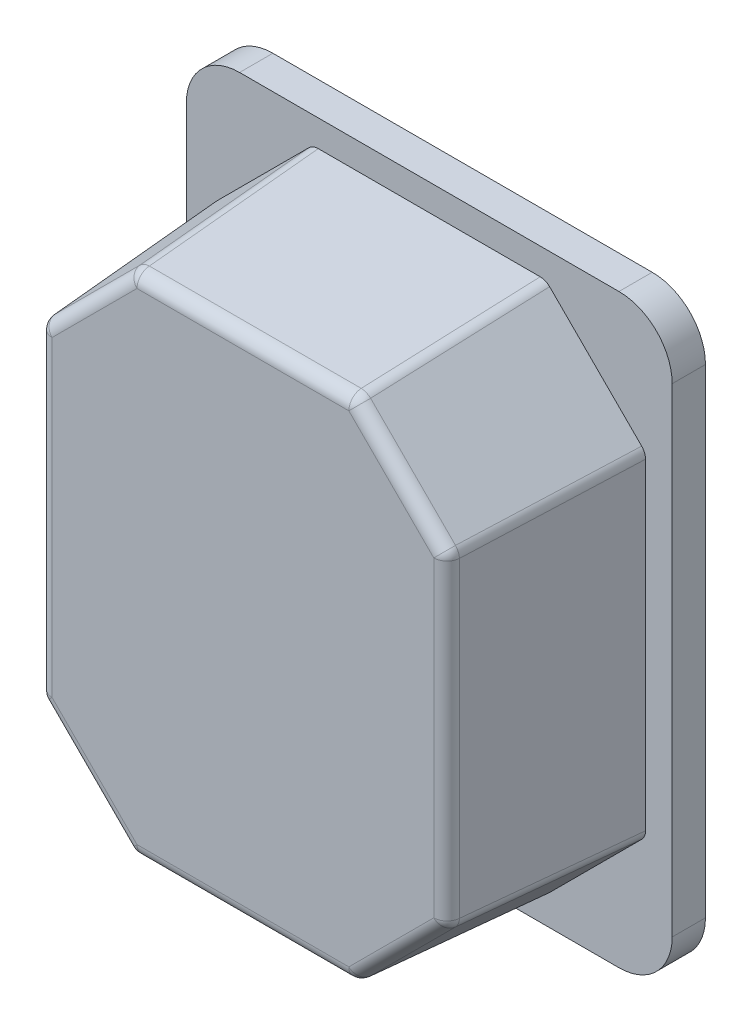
ISO-10303-21;
HEADER;
FILE_DESCRIPTION(('STEP AP214'),'2;1');
FILE_NAME('part.step','',(''),(''),'','','');
FILE_SCHEMA(('AUTOMOTIVE_DESIGN { 1 0 10303 214 1 1 1 1 }'));
ENDSEC;
DATA;
#1=APPLICATION_CONTEXT('core data for automotive mechanical design processes');
#2=APPLICATION_PROTOCOL_DEFINITION('international standard','automotive_design',2000,#1);
#3=PRODUCT_CONTEXT('',#1,'mechanical');
#4=PRODUCT('Part','Part','',(#3));
#5=PRODUCT_RELATED_PRODUCT_CATEGORY('part','',(#4));
#6=PRODUCT_DEFINITION_FORMATION('','',#4);
#7=PRODUCT_DEFINITION_CONTEXT('part definition',#1,'design');
#8=PRODUCT_DEFINITION('design','',#6,#7);
#9=PRODUCT_DEFINITION_SHAPE('','',#8);
#10=(LENGTH_UNIT() NAMED_UNIT(*) SI_UNIT(.MILLI.,.METRE.));
#11=(NAMED_UNIT(*) PLANE_ANGLE_UNIT() SI_UNIT($,.RADIAN.));
#12=(NAMED_UNIT(*) SI_UNIT($,.STERADIAN.) SOLID_ANGLE_UNIT());
#13=UNCERTAINTY_MEASURE_WITH_UNIT(LENGTH_MEASURE(1.E-05),#10,'distance_accuracy_value','');
#14=(GEOMETRIC_REPRESENTATION_CONTEXT(3) GLOBAL_UNCERTAINTY_ASSIGNED_CONTEXT((#13)) GLOBAL_UNIT_ASSIGNED_CONTEXT((#10,
#11,#12)) REPRESENTATION_CONTEXT('',''));
#15=CARTESIAN_POINT('',(0.,0.,0.));
#16=DIRECTION('',(0.,0.,1.));
#17=DIRECTION('',(1.,0.,0.));
#18=AXIS2_PLACEMENT_3D('',#15,#16,#17);
#19=CARTESIAN_POINT('',(-28.5,36.,5.));
#20=DIRECTION('',(0.,0.,1.));
#21=DIRECTION('',(1.,0.,0.));
#22=AXIS2_PLACEMENT_3D('',#19,#20,#21);
#23=PLANE('',#22);
#24=CARTESIAN_POINT('',(-28.5,36.,5.));
#25=DIRECTION('',(0.,0.,1.));
#26=DIRECTION('',(1.,0.,0.));
#27=AXIS2_PLACEMENT_3D('',#24,#25,#26);
#28=CIRCLE('',#27,8.);
#29=CARTESIAN_POINT('',(-28.5,44.,5.));
#30=VERTEX_POINT('',#29);
#31=CARTESIAN_POINT('',(-36.5,36.,5.));
#32=VERTEX_POINT('',#31);
#33=EDGE_CURVE('E733',#30,#32,#28,.T.);
#34=ORIENTED_EDGE('',*,*,#33,.T.);
#35=DIRECTION('',(0.,-1.,0.));
#36=VECTOR('',#35,1.);
#37=CARTESIAN_POINT('',(-36.5,36.,5.));
#38=LINE('',#37,#36);
#39=CARTESIAN_POINT('',(-36.5,-36.,5.));
#40=VERTEX_POINT('',#39);
#41=EDGE_CURVE('E736',#32,#40,#38,.T.);
#42=ORIENTED_EDGE('',*,*,#41,.T.);
#43=CARTESIAN_POINT('',(-28.5,-36.,5.));
#44=DIRECTION('',(0.,0.,1.));
#45=DIRECTION('',(1.,0.,0.));
#46=AXIS2_PLACEMENT_3D('',#43,#44,#45);
#47=CIRCLE('',#46,8.);
#48=CARTESIAN_POINT('',(-28.5,-44.,5.));
#49=VERTEX_POINT('',#48);
#50=EDGE_CURVE('E738',#40,#49,#47,.T.);
#51=ORIENTED_EDGE('',*,*,#50,.T.);
#52=DIRECTION('',(1.,0.,0.));
#53=VECTOR('',#52,1.);
#54=CARTESIAN_POINT('',(-28.5,-44.,5.));
#55=LINE('',#54,#53);
#56=CARTESIAN_POINT('',(28.5,-44.,5.));
#57=VERTEX_POINT('',#56);
#58=EDGE_CURVE('E740',#49,#57,#55,.T.);
#59=ORIENTED_EDGE('',*,*,#58,.T.);
#60=CARTESIAN_POINT('',(28.5,-36.,5.));
#61=DIRECTION('',(0.,0.,1.));
#62=DIRECTION('',(1.,0.,0.));
#63=AXIS2_PLACEMENT_3D('',#60,#61,#62);
#64=CIRCLE('',#63,8.);
#65=CARTESIAN_POINT('',(36.5,-36.,5.));
#66=VERTEX_POINT('',#65);
#67=EDGE_CURVE('E742',#57,#66,#64,.T.);
#68=ORIENTED_EDGE('',*,*,#67,.T.);
#69=DIRECTION('',(0.,1.,0.));
#70=VECTOR('',#69,1.);
#71=CARTESIAN_POINT('',(36.5,36.,5.));
#72=LINE('',#71,#70);
#73=CARTESIAN_POINT('',(36.5,36.,5.));
#74=VERTEX_POINT('',#73);
#75=EDGE_CURVE('E744',#66,#74,#72,.T.);
#76=ORIENTED_EDGE('',*,*,#75,.T.);
#77=CARTESIAN_POINT('',(28.5,36.,5.));
#78=DIRECTION('',(0.,0.,1.));
#79=DIRECTION('',(-1.,0.,0.));
#80=AXIS2_PLACEMENT_3D('',#77,#78,#79);
#81=CIRCLE('',#80,8.);
#82=CARTESIAN_POINT('',(28.5,44.,5.));
#83=VERTEX_POINT('',#82);
#84=EDGE_CURVE('E746',#74,#83,#81,.T.);
#85=ORIENTED_EDGE('',*,*,#84,.T.);
#86=DIRECTION('',(-1.,0.,0.));
#87=VECTOR('',#86,1.);
#88=CARTESIAN_POINT('',(-28.5,44.,5.));
#89=LINE('',#88,#87);
#90=EDGE_CURVE('E748',#83,#30,#89,.T.);
#91=ORIENTED_EDGE('',*,*,#90,.T.);
#92=EDGE_LOOP('',(#34,#42,#51,#59,#68,#76,#85,#91));
#93=FACE_BOUND('',#92,.T.);
#94=DIRECTION('',(0.,-1.,0.));
#95=VECTOR('',#94,1.);
#96=CARTESIAN_POINT('',(-32.5,25.,5.));
#97=LINE('',#96,#95);
#98=CARTESIAN_POINT('',(-32.5,24.1735908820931,5.));
#99=VERTEX_POINT('',#98);
#100=CARTESIAN_POINT('',(-32.5,-24.1735908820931,5.));
#101=VERTEX_POINT('',#100);
#102=EDGE_CURVE('E695',#99,#101,#97,.T.);
#103=ORIENTED_EDGE('',*,*,#102,.F.);
#104=CARTESIAN_POINT('',(-30.4951162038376,24.1695499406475,5.));
#105=DIRECTION('',(0.,0.,1.));
#106=DIRECTION('',(-0.923879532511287,0.38268343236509,0.));
#107=AXIS2_PLACEMENT_3D('',#104,#105,#106);
#108=ELLIPSE('',#107,2.00572052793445,2.);
#109=CARTESIAN_POINT('',(-31.9156405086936,25.5843594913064,5.));
#110=VERTEX_POINT('',#109);
#111=EDGE_CURVE('E847',#99,#110,#108,.F.);
#112=ORIENTED_EDGE('',*,*,#111,.T.);
#113=DIRECTION('',(-0.707106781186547,-0.707106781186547,0.));
#114=VECTOR('',#113,1.);
#115=CARTESIAN_POINT('',(-32.5,25.,5.));
#116=LINE('',#115,#114);
#117=CARTESIAN_POINT('',(-18.0843594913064,39.4156405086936,5.));
#118=VERTEX_POINT('',#117);
#119=EDGE_CURVE('E692',#118,#110,#116,.T.);
#120=ORIENTED_EDGE('',*,*,#119,.F.);
#121=CARTESIAN_POINT('',(-16.6695499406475,37.9951162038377,5.));
#122=DIRECTION('',(0.,0.,1.));
#123=DIRECTION('',(-0.38268343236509,0.923879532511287,0.));
#124=AXIS2_PLACEMENT_3D('',#121,#122,#123);
#125=ELLIPSE('',#124,2.00572052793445,2.);
#126=CARTESIAN_POINT('',(-16.6735908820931,40.,5.));
#127=VERTEX_POINT('',#126);
#128=EDGE_CURVE('E845',#118,#127,#125,.F.);
#129=ORIENTED_EDGE('',*,*,#128,.T.);
#130=DIRECTION('',(-1.,0.,0.));
#131=VECTOR('',#130,1.);
#132=CARTESIAN_POINT('',(-17.5,40.,5.));
#133=LINE('',#132,#131);
#134=CARTESIAN_POINT('',(16.6735908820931,40.,5.));
#135=VERTEX_POINT('',#134);
#136=EDGE_CURVE('E713',#135,#127,#133,.T.);
#137=ORIENTED_EDGE('',*,*,#136,.F.);
#138=CARTESIAN_POINT('',(16.6695499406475,37.9951162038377,5.));
#139=DIRECTION('',(0.,0.,1.));
#140=DIRECTION('',(0.38268343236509,0.923879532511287,0.));
#141=AXIS2_PLACEMENT_3D('',#138,#139,#140);
#142=ELLIPSE('',#141,2.00572052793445,2.);
#143=CARTESIAN_POINT('',(18.0843594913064,39.4156405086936,5.));
#144=VERTEX_POINT('',#143);
#145=EDGE_CURVE('E839',#135,#144,#142,.F.);
#146=ORIENTED_EDGE('',*,*,#145,.T.);
#147=DIRECTION('',(-0.707106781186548,0.707106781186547,0.));
#148=VECTOR('',#147,1.);
#149=CARTESIAN_POINT('',(17.5,40.,5.));
#150=LINE('',#149,#148);
#151=CARTESIAN_POINT('',(31.9156405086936,25.5843594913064,5.));
#152=VERTEX_POINT('',#151);
#153=EDGE_CURVE('E710',#152,#144,#150,.T.);
#154=ORIENTED_EDGE('',*,*,#153,.F.);
#155=CARTESIAN_POINT('',(30.4951162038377,24.1695499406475,5.));
#156=DIRECTION('',(0.,0.,1.));
#157=DIRECTION('',(0.923879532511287,0.38268343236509,0.));
#158=AXIS2_PLACEMENT_3D('',#155,#156,#157);
#159=ELLIPSE('',#158,2.00572052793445,2.);
#160=CARTESIAN_POINT('',(32.5,24.1735908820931,5.));
#161=VERTEX_POINT('',#160);
#162=EDGE_CURVE('E841',#152,#161,#159,.F.);
#163=ORIENTED_EDGE('',*,*,#162,.T.);
#164=DIRECTION('',(0.,1.,0.));
#165=VECTOR('',#164,1.);
#166=CARTESIAN_POINT('',(32.5,25.,5.));
#167=LINE('',#166,#165);
#168=CARTESIAN_POINT('',(32.5,-24.1735908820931,5.));
#169=VERTEX_POINT('',#168);
#170=EDGE_CURVE('E707',#169,#161,#167,.T.);
#171=ORIENTED_EDGE('',*,*,#170,.F.);
#172=CARTESIAN_POINT('',(30.4951162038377,-24.1695499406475,5.));
#173=DIRECTION('',(0.,0.,1.));
#174=DIRECTION('',(0.923879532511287,-0.38268343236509,0.));
#175=AXIS2_PLACEMENT_3D('',#172,#173,#174);
#176=ELLIPSE('',#175,2.00572052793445,2.);
#177=CARTESIAN_POINT('',(31.9156405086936,-25.5843594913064,5.));
#178=VERTEX_POINT('',#177);
#179=EDGE_CURVE('E843',#169,#178,#176,.F.);
#180=ORIENTED_EDGE('',*,*,#179,.T.);
#181=DIRECTION('',(0.707106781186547,0.707106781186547,0.));
#182=VECTOR('',#181,1.);
#183=CARTESIAN_POINT('',(17.5,-40.,5.));
#184=LINE('',#183,#182);
#185=CARTESIAN_POINT('',(18.0843594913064,-39.4156405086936,5.));
#186=VERTEX_POINT('',#185);
#187=EDGE_CURVE('E704',#186,#178,#184,.T.);
#188=ORIENTED_EDGE('',*,*,#187,.F.);
#189=CARTESIAN_POINT('',(16.6695499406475,-37.9951162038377,5.));
#190=DIRECTION('',(0.,0.,1.));
#191=DIRECTION('',(0.38268343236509,-0.923879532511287,0.));
#192=AXIS2_PLACEMENT_3D('',#189,#190,#191);
#193=ELLIPSE('',#192,2.00572052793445,2.);
#194=CARTESIAN_POINT('',(16.6735908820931,-40.,5.));
#195=VERTEX_POINT('',#194);
#196=EDGE_CURVE('E11',#186,#195,#193,.F.);
#197=ORIENTED_EDGE('',*,*,#196,.T.);
#198=DIRECTION('',(1.,0.,0.));
#199=VECTOR('',#198,1.);
#200=CARTESIAN_POINT('',(-17.5,-40.,5.));
#201=LINE('',#200,#199);
#202=CARTESIAN_POINT('',(-16.6735908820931,-40.,5.));
#203=VERTEX_POINT('',#202);
#204=EDGE_CURVE('E701',#203,#195,#201,.T.);
#205=ORIENTED_EDGE('',*,*,#204,.F.);
#206=CARTESIAN_POINT('',(-16.6695499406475,-37.9951162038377,5.));
#207=DIRECTION('',(0.,0.,1.));
#208=DIRECTION('',(-0.38268343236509,-0.923879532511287,0.));
#209=AXIS2_PLACEMENT_3D('',#206,#207,#208);
#210=ELLIPSE('',#209,2.00572052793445,2.);
#211=CARTESIAN_POINT('',(-18.0843594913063,-39.4156405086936,5.));
#212=VERTEX_POINT('',#211);
#213=EDGE_CURVE('E35',#203,#212,#210,.F.);
#214=ORIENTED_EDGE('',*,*,#213,.T.);
#215=DIRECTION('',(0.707106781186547,-0.707106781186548,0.));
#216=VECTOR('',#215,1.);
#217=CARTESIAN_POINT('',(-32.5,-25.,5.));
#218=LINE('',#217,#216);
#219=CARTESIAN_POINT('',(-31.9156405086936,-25.5843594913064,5.));
#220=VERTEX_POINT('',#219);
#221=EDGE_CURVE('E698',#220,#212,#218,.T.);
#222=ORIENTED_EDGE('',*,*,#221,.F.);
#223=CARTESIAN_POINT('',(-30.4951162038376,-24.1695499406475,5.));
#224=DIRECTION('',(0.,0.,1.));
#225=DIRECTION('',(-0.923879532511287,-0.38268343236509,0.));
#226=AXIS2_PLACEMENT_3D('',#223,#224,#225);
#227=ELLIPSE('',#226,2.00572052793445,2.);
#228=EDGE_CURVE('E849',#220,#101,#227,.F.);
#229=ORIENTED_EDGE('',*,*,#228,.T.);
#230=EDGE_LOOP('',(#103,#112,#120,#129,#137,#146,#154,#163,#171,#180,#188,#197,#205,#214,#222,#229));
#231=FACE_BOUND('',#230,.T.);
#232=ADVANCED_FACE('F27',(#93,#231),#23,.T.);
#233=CARTESIAN_POINT('',(-28.5,36.,5.));
#234=DIRECTION('',(0.,0.,-1.));
#235=DIRECTION('',(-1.,0.,0.));
#236=AXIS2_PLACEMENT_3D('',#233,#234,#235);
#237=CYLINDRICAL_SURFACE('',#236,8.);
#238=CARTESIAN_POINT('',(-28.5,36.,0.));
#239=DIRECTION('',(0.,0.,1.));
#240=DIRECTION('',(1.,0.,0.));
#241=AXIS2_PLACEMENT_3D('',#238,#239,#240);
#242=CIRCLE('',#241,8.);
#243=CARTESIAN_POINT('',(-28.5,44.,0.));
#244=VERTEX_POINT('',#243);
#245=CARTESIAN_POINT('',(-36.5,36.,0.));
#246=VERTEX_POINT('',#245);
#247=EDGE_CURVE('E716',#244,#246,#242,.T.);
#248=ORIENTED_EDGE('',*,*,#247,.T.);
#249=DIRECTION('',(0.,0.,-1.));
#250=VECTOR('',#249,1.);
#251=CARTESIAN_POINT('',(-36.5,36.,5.));
#252=LINE('',#251,#250);
#253=EDGE_CURVE('E771',#32,#246,#252,.T.);
#254=ORIENTED_EDGE('',*,*,#253,.F.);
#255=ORIENTED_EDGE('',*,*,#33,.F.);
#256=DIRECTION('',(0.,0.,-1.));
#257=VECTOR('',#256,1.);
#258=CARTESIAN_POINT('',(-28.5,44.,5.));
#259=LINE('',#258,#257);
#260=EDGE_CURVE('E750',#30,#244,#259,.T.);
#261=ORIENTED_EDGE('',*,*,#260,.T.);
#262=EDGE_LOOP('',(#248,#254,#255,#261));
#263=FACE_BOUND('',#262,.T.);
#264=ADVANCED_FACE('F29',(#263),#237,.T.);
#265=CARTESIAN_POINT('',(-36.5,36.,5.));
#266=DIRECTION('',(1.,0.,0.));
#267=DIRECTION('',(0.,0.,-1.));
#268=AXIS2_PLACEMENT_3D('',#265,#266,#267);
#269=PLANE('',#268);
#270=DIRECTION('',(0.,-1.,0.));
#271=VECTOR('',#270,1.);
#272=CARTESIAN_POINT('',(-36.5,36.,0.));
#273=LINE('',#272,#271);
#274=CARTESIAN_POINT('',(-36.5,-36.,0.));
#275=VERTEX_POINT('',#274);
#276=EDGE_CURVE('E719',#246,#275,#273,.T.);
#277=ORIENTED_EDGE('',*,*,#276,.T.);
#278=DIRECTION('',(0.,0.,-1.));
#279=VECTOR('',#278,1.);
#280=CARTESIAN_POINT('',(-36.5,-36.,5.));
#281=LINE('',#280,#279);
#282=EDGE_CURVE('E768',#40,#275,#281,.T.);
#283=ORIENTED_EDGE('',*,*,#282,.F.);
#284=ORIENTED_EDGE('',*,*,#41,.F.);
#285=ORIENTED_EDGE('',*,*,#253,.T.);
#286=EDGE_LOOP('',(#277,#283,#284,#285));
#287=FACE_BOUND('',#286,.T.);
#288=ADVANCED_FACE('F995',(#287),#269,.F.);
#289=CARTESIAN_POINT('',(-28.5,-36.,5.));
#290=DIRECTION('',(0.,0.,-1.));
#291=DIRECTION('',(-1.,0.,0.));
#292=AXIS2_PLACEMENT_3D('',#289,#290,#291);
#293=CYLINDRICAL_SURFACE('',#292,8.);
#294=CARTESIAN_POINT('',(-28.5,-36.,0.));
#295=DIRECTION('',(0.,0.,1.));
#296=DIRECTION('',(1.,0.,0.));
#297=AXIS2_PLACEMENT_3D('',#294,#295,#296);
#298=CIRCLE('',#297,8.);
#299=CARTESIAN_POINT('',(-28.5,-44.,0.));
#300=VERTEX_POINT('',#299);
#301=EDGE_CURVE('E721',#275,#300,#298,.T.);
#302=ORIENTED_EDGE('',*,*,#301,.T.);
#303=DIRECTION('',(0.,0.,-1.));
#304=VECTOR('',#303,1.);
#305=CARTESIAN_POINT('',(-28.5,-44.,5.));
#306=LINE('',#305,#304);
#307=EDGE_CURVE('E765',#49,#300,#306,.T.);
#308=ORIENTED_EDGE('',*,*,#307,.F.);
#309=ORIENTED_EDGE('',*,*,#50,.F.);
#310=ORIENTED_EDGE('',*,*,#282,.T.);
#311=EDGE_LOOP('',(#302,#308,#309,#310));
#312=FACE_BOUND('',#311,.T.);
#313=ADVANCED_FACE('F1020',(#312),#293,.T.);
#314=CARTESIAN_POINT('',(-28.5,-44.,5.));
#315=DIRECTION('',(0.,1.,0.));
#316=DIRECTION('',(0.,0.,1.));
#317=AXIS2_PLACEMENT_3D('',#314,#315,#316);
#318=PLANE('',#317);
#319=DIRECTION('',(1.,0.,0.));
#320=VECTOR('',#319,1.);
#321=CARTESIAN_POINT('',(-28.5,-44.,0.));
#322=LINE('',#321,#320);
#323=CARTESIAN_POINT('',(28.5,-44.,0.));
#324=VERTEX_POINT('',#323);
#325=EDGE_CURVE('E723',#300,#324,#322,.T.);
#326=ORIENTED_EDGE('',*,*,#325,.T.);
#327=DIRECTION('',(0.,0.,-1.));
#328=VECTOR('',#327,1.);
#329=CARTESIAN_POINT('',(28.5,-44.,5.));
#330=LINE('',#329,#328);
#331=EDGE_CURVE('E762',#57,#324,#330,.T.);
#332=ORIENTED_EDGE('',*,*,#331,.F.);
#333=ORIENTED_EDGE('',*,*,#58,.F.);
#334=ORIENTED_EDGE('',*,*,#307,.T.);
#335=EDGE_LOOP('',(#326,#332,#333,#334));
#336=FACE_BOUND('',#335,.T.);
#337=ADVANCED_FACE('F1016',(#336),#318,.F.);
#338=CARTESIAN_POINT('',(28.5,-36.,5.));
#339=DIRECTION('',(0.,0.,-1.));
#340=DIRECTION('',(-1.,0.,0.));
#341=AXIS2_PLACEMENT_3D('',#338,#339,#340);
#342=CYLINDRICAL_SURFACE('',#341,8.);
#343=CARTESIAN_POINT('',(28.5,-36.,0.));
#344=DIRECTION('',(0.,0.,1.));
#345=DIRECTION('',(1.,0.,0.));
#346=AXIS2_PLACEMENT_3D('',#343,#344,#345);
#347=CIRCLE('',#346,8.);
#348=CARTESIAN_POINT('',(36.5,-36.,0.));
#349=VERTEX_POINT('',#348);
#350=EDGE_CURVE('E725',#324,#349,#347,.T.);
#351=ORIENTED_EDGE('',*,*,#350,.T.);
#352=DIRECTION('',(0.,0.,-1.));
#353=VECTOR('',#352,1.);
#354=CARTESIAN_POINT('',(36.5,-36.,5.));
#355=LINE('',#354,#353);
#356=EDGE_CURVE('E759',#66,#349,#355,.T.);
#357=ORIENTED_EDGE('',*,*,#356,.F.);
#358=ORIENTED_EDGE('',*,*,#67,.F.);
#359=ORIENTED_EDGE('',*,*,#331,.T.);
#360=EDGE_LOOP('',(#351,#357,#358,#359));
#361=FACE_BOUND('',#360,.T.);
#362=ADVANCED_FACE('F1012',(#361),#342,.T.);
#363=CARTESIAN_POINT('',(36.5,36.,5.));
#364=DIRECTION('',(-1.,0.,0.));
#365=DIRECTION('',(0.,0.,1.));
#366=AXIS2_PLACEMENT_3D('',#363,#364,#365);
#367=PLANE('',#366);
#368=DIRECTION('',(0.,1.,0.));
#369=VECTOR('',#368,1.);
#370=CARTESIAN_POINT('',(36.5,36.,0.));
#371=LINE('',#370,#369);
#372=CARTESIAN_POINT('',(36.5,36.,0.));
#373=VERTEX_POINT('',#372);
#374=EDGE_CURVE('E727',#349,#373,#371,.T.);
#375=ORIENTED_EDGE('',*,*,#374,.T.);
#376=DIRECTION('',(0.,0.,-1.));
#377=VECTOR('',#376,1.);
#378=CARTESIAN_POINT('',(36.5,36.,5.));
#379=LINE('',#378,#377);
#380=EDGE_CURVE('E756',#74,#373,#379,.T.);
#381=ORIENTED_EDGE('',*,*,#380,.F.);
#382=ORIENTED_EDGE('',*,*,#75,.F.);
#383=ORIENTED_EDGE('',*,*,#356,.T.);
#384=EDGE_LOOP('',(#375,#381,#382,#383));
#385=FACE_BOUND('',#384,.T.);
#386=ADVANCED_FACE('F1008',(#385),#367,.F.);
#387=CARTESIAN_POINT('',(28.5,36.,5.));
#388=DIRECTION('',(0.,0.,-1.));
#389=DIRECTION('',(-1.,0.,0.));
#390=AXIS2_PLACEMENT_3D('',#387,#388,#389);
#391=CYLINDRICAL_SURFACE('',#390,8.);
#392=CARTESIAN_POINT('',(28.5,36.,0.));
#393=DIRECTION('',(0.,0.,1.));
#394=DIRECTION('',(-1.,0.,0.));
#395=AXIS2_PLACEMENT_3D('',#392,#393,#394);
#396=CIRCLE('',#395,8.);
#397=CARTESIAN_POINT('',(28.5,44.,0.));
#398=VERTEX_POINT('',#397);
#399=EDGE_CURVE('E729',#373,#398,#396,.T.);
#400=ORIENTED_EDGE('',*,*,#399,.T.);
#401=DIRECTION('',(0.,0.,-1.));
#402=VECTOR('',#401,1.);
#403=CARTESIAN_POINT('',(28.5,44.,5.));
#404=LINE('',#403,#402);
#405=EDGE_CURVE('E753',#83,#398,#404,.T.);
#406=ORIENTED_EDGE('',*,*,#405,.F.);
#407=ORIENTED_EDGE('',*,*,#84,.F.);
#408=ORIENTED_EDGE('',*,*,#380,.T.);
#409=EDGE_LOOP('',(#400,#406,#407,#408));
#410=FACE_BOUND('',#409,.T.);
#411=ADVANCED_FACE('F1004',(#410),#391,.T.);
#412=CARTESIAN_POINT('',(-28.5,44.,5.));
#413=DIRECTION('',(0.,-1.,0.));
#414=DIRECTION('',(0.,0.,-1.));
#415=AXIS2_PLACEMENT_3D('',#412,#413,#414);
#416=PLANE('',#415);
#417=DIRECTION('',(-1.,0.,0.));
#418=VECTOR('',#417,1.);
#419=CARTESIAN_POINT('',(-28.5,44.,0.));
#420=LINE('',#419,#418);
#421=EDGE_CURVE('E731',#398,#244,#420,.T.);
#422=ORIENTED_EDGE('',*,*,#421,.T.);
#423=ORIENTED_EDGE('',*,*,#260,.F.);
#424=ORIENTED_EDGE('',*,*,#90,.F.);
#425=ORIENTED_EDGE('',*,*,#405,.T.);
#426=EDGE_LOOP('',(#422,#423,#424,#425));
#427=FACE_BOUND('',#426,.T.);
#428=ADVANCED_FACE('F1001',(#427),#416,.F.);
#429=CARTESIAN_POINT('',(-28.5,36.,0.));
#430=DIRECTION('',(0.,0.,1.));
#431=DIRECTION('',(1.,0.,0.));
#432=AXIS2_PLACEMENT_3D('',#429,#430,#431);
#433=PLANE('',#432);
#434=DIRECTION('',(-1.,0.,0.));
#435=VECTOR('',#434,1.);
#436=CARTESIAN_POINT('',(-28.5,42.5,0.));
#437=LINE('',#436,#435);
#438=CARTESIAN_POINT('',(28.5,42.5,0.));
#439=VERTEX_POINT('',#438);
#440=CARTESIAN_POINT('',(-28.5,42.5,0.));
#441=VERTEX_POINT('',#440);
#442=EDGE_CURVE('E606',#439,#441,#437,.T.);
#443=ORIENTED_EDGE('',*,*,#442,.T.);
#444=CARTESIAN_POINT('',(-28.5,36.,0.));
#445=DIRECTION('',(0.,0.,1.));
#446=DIRECTION('',(1.,0.,0.));
#447=AXIS2_PLACEMENT_3D('',#444,#445,#446);
#448=CIRCLE('',#447,6.5);
#449=CARTESIAN_POINT('',(-35.,36.,0.));
#450=VERTEX_POINT('',#449);
#451=EDGE_CURVE('E431',#441,#450,#448,.T.);
#452=ORIENTED_EDGE('',*,*,#451,.T.);
#453=DIRECTION('',(0.,-1.,0.));
#454=VECTOR('',#453,1.);
#455=CARTESIAN_POINT('',(-35.,36.,0.));
#456=LINE('',#455,#454);
#457=CARTESIAN_POINT('',(-35.,-36.,0.));
#458=VERTEX_POINT('',#457);
#459=EDGE_CURVE('E605',#450,#458,#456,.T.);
#460=ORIENTED_EDGE('',*,*,#459,.T.);
#461=CARTESIAN_POINT('',(-28.5,-36.,0.));
#462=DIRECTION('',(0.,0.,1.));
#463=DIRECTION('',(1.,0.,0.));
#464=AXIS2_PLACEMENT_3D('',#461,#462,#463);
#465=CIRCLE('',#464,6.5);
#466=CARTESIAN_POINT('',(-28.5,-42.5,0.));
#467=VERTEX_POINT('',#466);
#468=EDGE_CURVE('E42',#458,#467,#465,.T.);
#469=ORIENTED_EDGE('',*,*,#468,.T.);
#470=DIRECTION('',(1.,0.,0.));
#471=VECTOR('',#470,1.);
#472=CARTESIAN_POINT('',(-28.5,-42.5,0.));
#473=LINE('',#472,#471);
#474=CARTESIAN_POINT('',(28.5,-42.5,0.));
#475=VERTEX_POINT('',#474);
#476=EDGE_CURVE('E618',#467,#475,#473,.T.);
#477=ORIENTED_EDGE('',*,*,#476,.T.);
#478=CARTESIAN_POINT('',(28.5,-36.,0.));
#479=DIRECTION('',(0.,0.,1.));
#480=DIRECTION('',(1.,0.,0.));
#481=AXIS2_PLACEMENT_3D('',#478,#479,#480);
#482=CIRCLE('',#481,6.5);
#483=CARTESIAN_POINT('',(35.,-36.,0.));
#484=VERTEX_POINT('',#483);
#485=EDGE_CURVE('E615',#475,#484,#482,.T.);
#486=ORIENTED_EDGE('',*,*,#485,.T.);
#487=DIRECTION('',(0.,1.,0.));
#488=VECTOR('',#487,1.);
#489=CARTESIAN_POINT('',(35.,36.,0.));
#490=LINE('',#489,#488);
#491=CARTESIAN_POINT('',(35.,36.,0.));
#492=VERTEX_POINT('',#491);
#493=EDGE_CURVE('E612',#484,#492,#490,.T.);
#494=ORIENTED_EDGE('',*,*,#493,.T.);
#495=CARTESIAN_POINT('',(28.5,36.,0.));
#496=DIRECTION('',(0.,0.,1.));
#497=DIRECTION('',(1.,0.,0.));
#498=AXIS2_PLACEMENT_3D('',#495,#496,#497);
#499=CIRCLE('',#498,6.5);
#500=EDGE_CURVE('E609',#492,#439,#499,.T.);
#501=ORIENTED_EDGE('',*,*,#500,.T.);
#502=EDGE_LOOP('',(#443,#452,#460,#469,#477,#486,#494,#501));
#503=FACE_BOUND('',#502,.T.);
#504=ORIENTED_EDGE('',*,*,#247,.F.);
#505=ORIENTED_EDGE('',*,*,#421,.F.);
#506=ORIENTED_EDGE('',*,*,#399,.F.);
#507=ORIENTED_EDGE('',*,*,#374,.F.);
#508=ORIENTED_EDGE('',*,*,#350,.F.);
#509=ORIENTED_EDGE('',*,*,#325,.F.);
#510=ORIENTED_EDGE('',*,*,#301,.F.);
#511=ORIENTED_EDGE('',*,*,#276,.F.);
#512=EDGE_LOOP('',(#504,#505,#506,#507,#508,#509,#510,#511));
#513=FACE_BOUND('',#512,.T.);
#514=ADVANCED_FACE('F999',(#503,#513),#433,.F.);
#515=CARTESIAN_POINT('',(-32.5,25.,5.));
#516=DIRECTION('',(-0.70538430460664,0.70538430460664,0.0697564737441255));
#517=DIRECTION('',(-0.707106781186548,-0.707106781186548,0.));
#518=AXIS2_PLACEMENT_3D('',#515,#516,#517);
#519=PLANE('',#518);
#520=DIRECTION('',(-0.707106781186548,-0.707106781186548,0.));
#521=VECTOR('',#520,1.);
#522=CARTESIAN_POINT('',(-31.2075128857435,23.7075128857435,31.1395129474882));
#523=LINE('',#522,#521);
#524=CARTESIAN_POINT('',(-30.0877877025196,24.8272380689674,31.1395129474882));
#525=VERTEX_POINT('',#524);
#526=CARTESIAN_POINT('',(-17.3272380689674,37.5877877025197,31.1395129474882));
#527=VERTEX_POINT('',#526);
#528=EDGE_CURVE('E50',#525,#527,#523,.F.);
#529=ORIENTED_EDGE('',*,*,#528,.T.);
#530=DIRECTION('',(0.0288820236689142,-0.0697273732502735,0.997147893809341));
#531=VECTOR('',#530,1.);
#532=CARTESIAN_POINT('',(-18.0673534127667,39.3745842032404,5.58713252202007));
#533=LINE('',#532,#531);
#534=EDGE_CURVE('E837',#527,#118,#533,.F.);
#535=ORIENTED_EDGE('',*,*,#534,.T.);
#536=ORIENTED_EDGE('',*,*,#119,.T.);
#537=DIRECTION('',(0.0697273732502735,-0.0288820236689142,0.997147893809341));
#538=VECTOR('',#537,1.);
#539=CARTESIAN_POINT('',(-31.9173047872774,25.5850488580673,4.9761997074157));
#540=LINE('',#539,#538);
#541=EDGE_CURVE('E834',#110,#525,#540,.T.);
#542=ORIENTED_EDGE('',*,*,#541,.T.);
#543=EDGE_LOOP('',(#529,#535,#536,#542));
#544=FACE_BOUND('',#543,.T.);
#545=ADVANCED_FACE('F1052',(#544),#519,.T.);
#546=CARTESIAN_POINT('',(-32.5,25.,5.));
#547=DIRECTION('',(-0.997564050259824,0.,0.0697564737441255));
#548=DIRECTION('',(0.0697564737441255,0.,0.997564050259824));
#549=AXIS2_PLACEMENT_3D('',#546,#547,#548);
#550=PLANE('',#549);
#551=DIRECTION('',(0.,-1.,0.));
#552=VECTOR('',#551,1.);
#553=CARTESIAN_POINT('',(-30.672147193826,25.,31.1395129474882));
#554=LINE('',#553,#552);
#555=CARTESIAN_POINT('',(-30.672147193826,-23.4164694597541,31.1395129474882));
#556=VERTEX_POINT('',#555);
#557=CARTESIAN_POINT('',(-30.672147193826,23.4164694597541,31.1395129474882));
#558=VERTEX_POINT('',#557);
#559=EDGE_CURVE('E830',#556,#558,#554,.F.);
#560=ORIENTED_EDGE('',*,*,#559,.T.);
#561=DIRECTION('',(0.0697273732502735,-0.0288820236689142,0.997147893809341));
#562=VECTOR('',#561,1.);
#563=CARTESIAN_POINT('',(-32.5016642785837,24.174280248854,4.9761997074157));
#564=LINE('',#563,#562);
#565=EDGE_CURVE('E832',#558,#99,#564,.F.);
#566=ORIENTED_EDGE('',*,*,#565,.T.);
#567=ORIENTED_EDGE('',*,*,#102,.T.);
#568=DIRECTION('',(0.0697273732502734,0.0288820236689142,0.997147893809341));
#569=VECTOR('',#568,1.);
#570=CARTESIAN_POINT('',(-32.4009708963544,-24.1325716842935,6.41618216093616));
#571=LINE('',#570,#569);
#572=EDGE_CURVE('E828',#101,#556,#571,.T.);
#573=ORIENTED_EDGE('',*,*,#572,.T.);
#574=EDGE_LOOP('',(#560,#566,#567,#573));
#575=FACE_BOUND('',#574,.T.);
#576=ADVANCED_FACE('F880',(#575),#550,.T.);
#577=CARTESIAN_POINT('',(-32.5,-25.,5.));
#578=DIRECTION('',(-0.70538430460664,-0.70538430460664,0.0697564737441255));
#579=DIRECTION('',(0.707106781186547,-0.707106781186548,0.));
#580=AXIS2_PLACEMENT_3D('',#577,#578,#579);
#581=PLANE('',#580);
#582=DIRECTION('',(0.707106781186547,-0.707106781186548,0.));
#583=VECTOR('',#582,1.);
#584=CARTESIAN_POINT('',(-31.2075128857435,-23.7075128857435,31.1395129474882));
#585=LINE('',#584,#583);
#586=CARTESIAN_POINT('',(-17.3272380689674,-37.5877877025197,31.1395129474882));
#587=VERTEX_POINT('',#586);
#588=CARTESIAN_POINT('',(-30.0877877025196,-24.8272380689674,31.1395129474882));
#589=VERTEX_POINT('',#588);
#590=EDGE_CURVE('E824',#587,#589,#585,.F.);
#591=ORIENTED_EDGE('',*,*,#590,.T.);
#592=DIRECTION('',(0.0697273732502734,0.0288820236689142,0.997147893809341));
#593=VECTOR('',#592,1.);
#594=CARTESIAN_POINT('',(-31.9173047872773,-25.5850488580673,4.9761997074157));
#595=LINE('',#594,#593);
#596=EDGE_CURVE('E826',#589,#220,#595,.F.);
#597=ORIENTED_EDGE('',*,*,#596,.T.);
#598=ORIENTED_EDGE('',*,*,#221,.T.);
#599=DIRECTION('',(0.0288820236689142,0.0697273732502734,0.997147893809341));
#600=VECTOR('',#599,1.);
#601=CARTESIAN_POINT('',(-18.0673534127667,-39.3745842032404,5.58713252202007));
#602=LINE('',#601,#600);
#603=EDGE_CURVE('E822',#212,#587,#602,.T.);
#604=ORIENTED_EDGE('',*,*,#603,.T.);
#605=EDGE_LOOP('',(#591,#597,#598,#604));
#606=FACE_BOUND('',#605,.T.);
#607=ADVANCED_FACE('F860',(#606),#581,.T.);
#608=CARTESIAN_POINT('',(-17.5,-40.,5.));
#609=DIRECTION('',(0.,-0.997564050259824,0.0697564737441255));
#610=DIRECTION('',(0.,-0.0697564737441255,-0.997564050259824));
#611=AXIS2_PLACEMENT_3D('',#608,#609,#610);
#612=PLANE('',#611);
#613=DIRECTION('',(1.,0.,0.));
#614=VECTOR('',#613,1.);
#615=CARTESIAN_POINT('',(-17.5,-38.172147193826,31.1395129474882));
#616=LINE('',#615,#614);
#617=CARTESIAN_POINT('',(15.9164694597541,-38.172147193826,31.1395129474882));
#618=VERTEX_POINT('',#617);
#619=CARTESIAN_POINT('',(-15.9164694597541,-38.172147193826,31.1395129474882));
#620=VERTEX_POINT('',#619);
#621=EDGE_CURVE('E818',#618,#620,#616,.F.);
#622=ORIENTED_EDGE('',*,*,#621,.T.);
#623=DIRECTION('',(0.0288820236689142,0.0697273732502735,0.997147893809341));
#624=VECTOR('',#623,1.);
#625=CARTESIAN_POINT('',(-16.674280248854,-40.0016642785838,4.9761997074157));
#626=LINE('',#625,#624);
#627=EDGE_CURVE('E820',#620,#203,#626,.F.);
#628=ORIENTED_EDGE('',*,*,#627,.T.);
#629=ORIENTED_EDGE('',*,*,#204,.T.);
#630=DIRECTION('',(-0.0288820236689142,0.0697273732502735,0.997147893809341));
#631=VECTOR('',#630,1.);
#632=CARTESIAN_POINT('',(16.6450842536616,-39.9311789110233,5.98418742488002));
#633=LINE('',#632,#631);
#634=EDGE_CURVE('E816',#195,#618,#633,.T.);
#635=ORIENTED_EDGE('',*,*,#634,.T.);
#636=EDGE_LOOP('',(#622,#628,#629,#635));
#637=FACE_BOUND('',#636,.T.);
#638=ADVANCED_FACE('F980',(#637),#612,.T.);
#639=CARTESIAN_POINT('',(17.5,-40.,5.));
#640=DIRECTION('',(0.70538430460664,-0.70538430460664,0.0697564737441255));
#641=DIRECTION('',(0.707106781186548,0.707106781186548,0.));
#642=AXIS2_PLACEMENT_3D('',#639,#640,#641);
#643=PLANE('',#642);
#644=ORIENTED_EDGE('',*,*,#187,.T.);
#645=DIRECTION('',(-0.0697273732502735,0.0288820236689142,0.997147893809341));
#646=VECTOR('',#645,1.);
#647=CARTESIAN_POINT('',(31.8745842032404,-25.5673534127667,5.58713252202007));
#648=LINE('',#647,#646);
#649=CARTESIAN_POINT('',(30.0877877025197,-24.8272380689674,31.1395129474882));
#650=VERTEX_POINT('',#649);
#651=EDGE_CURVE('E814',#178,#650,#648,.T.);
#652=ORIENTED_EDGE('',*,*,#651,.T.);
#653=DIRECTION('',(0.707106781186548,0.707106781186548,0.));
#654=VECTOR('',#653,1.);
#655=CARTESIAN_POINT('',(16.2075128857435,-38.7075128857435,31.1395129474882));
#656=LINE('',#655,#654);
#657=CARTESIAN_POINT('',(17.3272380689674,-37.5877877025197,31.1395129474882));
#658=VERTEX_POINT('',#657);
#659=EDGE_CURVE('E812',#650,#658,#656,.F.);
#660=ORIENTED_EDGE('',*,*,#659,.T.);
#661=DIRECTION('',(-0.0288820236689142,0.0697273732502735,0.997147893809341));
#662=VECTOR('',#661,1.);
#663=CARTESIAN_POINT('',(18.0850488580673,-39.4173047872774,4.9761997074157));
#664=LINE('',#663,#662);
#665=EDGE_CURVE('E810',#658,#186,#664,.F.);
#666=ORIENTED_EDGE('',*,*,#665,.T.);
#667=EDGE_LOOP('',(#644,#652,#660,#666));
#668=FACE_BOUND('',#667,.T.);
#669=ADVANCED_FACE('F967',(#668),#643,.T.);
#670=CARTESIAN_POINT('',(32.5,25.,5.));
#671=DIRECTION('',(0.997564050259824,0.,0.0697564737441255));
#672=DIRECTION('',(0.0697564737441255,0.,-0.997564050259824));
#673=AXIS2_PLACEMENT_3D('',#670,#671,#672);
#674=PLANE('',#673);
#675=ORIENTED_EDGE('',*,*,#170,.T.);
#676=DIRECTION('',(-0.0697273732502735,-0.0288820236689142,0.997147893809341));
#677=VECTOR('',#676,1.);
#678=CARTESIAN_POINT('',(32.5016642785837,24.174280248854,4.9761997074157));
#679=LINE('',#678,#677);
#680=CARTESIAN_POINT('',(30.672147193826,23.4164694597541,31.1395129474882));
#681=VERTEX_POINT('',#680);
#682=EDGE_CURVE('E808',#161,#681,#679,.T.);
#683=ORIENTED_EDGE('',*,*,#682,.T.);
#684=DIRECTION('',(0.,1.,0.));
#685=VECTOR('',#684,1.);
#686=CARTESIAN_POINT('',(30.672147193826,25.,31.1395129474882));
#687=LINE('',#686,#685);
#688=CARTESIAN_POINT('',(30.672147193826,-23.4164694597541,31.1395129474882));
#689=VERTEX_POINT('',#688);
#690=EDGE_CURVE('E806',#681,#689,#687,.F.);
#691=ORIENTED_EDGE('',*,*,#690,.T.);
#692=DIRECTION('',(-0.0697273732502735,0.0288820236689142,0.997147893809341));
#693=VECTOR('',#692,1.);
#694=CARTESIAN_POINT('',(32.4009708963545,-24.1325716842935,6.41618216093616));
#695=LINE('',#694,#693);
#696=EDGE_CURVE('E804',#689,#169,#695,.F.);
#697=ORIENTED_EDGE('',*,*,#696,.T.);
#698=EDGE_LOOP('',(#675,#683,#691,#697));
#699=FACE_BOUND('',#698,.T.);
#700=ADVANCED_FACE('F942',(#699),#674,.T.);
#701=CARTESIAN_POINT('',(17.5,40.,5.));
#702=DIRECTION('',(0.705384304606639,0.70538430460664,0.0697564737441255));
#703=DIRECTION('',(-0.707106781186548,0.707106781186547,0.));
#704=AXIS2_PLACEMENT_3D('',#701,#702,#703);
#705=PLANE('',#704);
#706=ORIENTED_EDGE('',*,*,#153,.T.);
#707=DIRECTION('',(-0.0288820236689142,-0.0697273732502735,0.997147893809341));
#708=VECTOR('',#707,1.);
#709=CARTESIAN_POINT('',(18.0850488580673,39.4173047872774,4.9761997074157));
#710=LINE('',#709,#708);
#711=CARTESIAN_POINT('',(17.3272380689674,37.5877877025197,31.1395129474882));
#712=VERTEX_POINT('',#711);
#713=EDGE_CURVE('E802',#144,#712,#710,.T.);
#714=ORIENTED_EDGE('',*,*,#713,.T.);
#715=DIRECTION('',(-0.707106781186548,0.707106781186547,0.));
#716=VECTOR('',#715,1.);
#717=CARTESIAN_POINT('',(16.2075128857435,38.7075128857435,31.1395129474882));
#718=LINE('',#717,#716);
#719=CARTESIAN_POINT('',(30.0877877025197,24.8272380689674,31.1395129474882));
#720=VERTEX_POINT('',#719);
#721=EDGE_CURVE('E800',#712,#720,#718,.F.);
#722=ORIENTED_EDGE('',*,*,#721,.T.);
#723=DIRECTION('',(-0.0697273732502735,-0.0288820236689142,0.997147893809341));
#724=VECTOR('',#723,1.);
#725=CARTESIAN_POINT('',(31.8745842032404,25.5673534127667,5.58713252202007));
#726=LINE('',#725,#724);
#727=EDGE_CURVE('E798',#720,#152,#726,.F.);
#728=ORIENTED_EDGE('',*,*,#727,.T.);
#729=EDGE_LOOP('',(#706,#714,#722,#728));
#730=FACE_BOUND('',#729,.T.);
#731=ADVANCED_FACE('F924',(#730),#705,.T.);
#732=CARTESIAN_POINT('',(-17.5,40.,5.));
#733=DIRECTION('',(0.,0.997564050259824,0.0697564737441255));
#734=DIRECTION('',(0.,-0.0697564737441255,0.997564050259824));
#735=AXIS2_PLACEMENT_3D('',#732,#733,#734);
#736=PLANE('',#735);
#737=DIRECTION('',(-1.,0.,0.));
#738=VECTOR('',#737,1.);
#739=CARTESIAN_POINT('',(-17.5,38.172147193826,31.1395129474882));
#740=LINE('',#739,#738);
#741=CARTESIAN_POINT('',(-15.9164694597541,38.172147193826,31.1395129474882));
#742=VERTEX_POINT('',#741);
#743=CARTESIAN_POINT('',(15.9164694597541,38.172147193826,31.1395129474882));
#744=VERTEX_POINT('',#743);
#745=EDGE_CURVE('E793',#742,#744,#740,.F.);
#746=ORIENTED_EDGE('',*,*,#745,.T.);
#747=DIRECTION('',(-0.0288820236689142,-0.0697273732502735,0.997147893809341));
#748=VECTOR('',#747,1.);
#749=CARTESIAN_POINT('',(16.6450842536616,39.9311789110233,5.98418742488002));
#750=LINE('',#749,#748);
#751=EDGE_CURVE('E796',#744,#135,#750,.F.);
#752=ORIENTED_EDGE('',*,*,#751,.T.);
#753=ORIENTED_EDGE('',*,*,#136,.T.);
#754=DIRECTION('',(0.0288820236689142,-0.0697273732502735,0.997147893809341));
#755=VECTOR('',#754,1.);
#756=CARTESIAN_POINT('',(-16.674280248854,40.0016642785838,4.9761997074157));
#757=LINE('',#756,#755);
#758=EDGE_CURVE('E791',#127,#742,#757,.T.);
#759=ORIENTED_EDGE('',*,*,#758,.T.);
#760=EDGE_LOOP('',(#746,#752,#753,#759));
#761=FACE_BOUND('',#760,.T.);
#762=ADVANCED_FACE('F912',(#761),#736,.T.);
#763=CARTESIAN_POINT('',(-57.5,0.,33.));
#764=DIRECTION('',(0.,0.,-1.));
#765=DIRECTION('',(-1.,0.,0.));
#766=AXIS2_PLACEMENT_3D('',#763,#764,#765);
#767=PLANE('',#766);
#768=DIRECTION('',(0.707106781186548,-0.707106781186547,0.));
#769=VECTOR('',#768,1.);
#770=CARTESIAN_POINT('',(-2.70325572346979,54.7967442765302,33.));
#771=LINE('',#770,#769);
#772=CARTESIAN_POINT('',(28.6770190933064,23.4164694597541,33.));
#773=VERTEX_POINT('',#772);
#774=CARTESIAN_POINT('',(15.9164694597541,36.1770190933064,33.));
#775=VERTEX_POINT('',#774);
#776=EDGE_CURVE('E786',#773,#775,#771,.F.);
#777=ORIENTED_EDGE('',*,*,#776,.T.);
#778=DIRECTION('',(1.,0.,0.));
#779=VECTOR('',#778,1.);
#780=CARTESIAN_POINT('',(-57.5,36.1770190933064,33.));
#781=LINE('',#780,#779);
#782=CARTESIAN_POINT('',(-15.9164694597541,36.1770190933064,33.));
#783=VERTEX_POINT('',#782);
#784=EDGE_CURVE('E788',#775,#783,#781,.F.);
#785=ORIENTED_EDGE('',*,*,#784,.T.);
#786=DIRECTION('',(0.707106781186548,0.707106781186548,0.));
#787=VECTOR('',#786,1.);
#788=CARTESIAN_POINT('',(-54.7967442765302,-2.70325572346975,33.));
#789=LINE('',#788,#787);
#790=CARTESIAN_POINT('',(-28.6770190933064,23.4164694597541,33.));
#791=VERTEX_POINT('',#790);
#792=EDGE_CURVE('E774',#783,#791,#789,.F.);
#793=ORIENTED_EDGE('',*,*,#792,.T.);
#794=DIRECTION('',(0.,1.,0.));
#795=VECTOR('',#794,1.);
#796=CARTESIAN_POINT('',(-28.6770190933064,0.,33.));
#797=LINE('',#796,#795);
#798=CARTESIAN_POINT('',(-28.6770190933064,-23.4164694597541,33.));
#799=VERTEX_POINT('',#798);
#800=EDGE_CURVE('E776',#791,#799,#797,.F.);
#801=ORIENTED_EDGE('',*,*,#800,.T.);
#802=DIRECTION('',(-0.707106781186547,0.707106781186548,0.));
#803=VECTOR('',#802,1.);
#804=CARTESIAN_POINT('',(-54.7967442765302,2.70325572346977,33.));
#805=LINE('',#804,#803);
#806=CARTESIAN_POINT('',(-15.9164694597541,-36.1770190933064,33.));
#807=VERTEX_POINT('',#806);
#808=EDGE_CURVE('E778',#799,#807,#805,.F.);
#809=ORIENTED_EDGE('',*,*,#808,.T.);
#810=DIRECTION('',(-1.,0.,0.));
#811=VECTOR('',#810,1.);
#812=CARTESIAN_POINT('',(-57.5,-36.1770190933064,33.));
#813=LINE('',#812,#811);
#814=CARTESIAN_POINT('',(15.9164694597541,-36.1770190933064,33.));
#815=VERTEX_POINT('',#814);
#816=EDGE_CURVE('E780',#807,#815,#813,.F.);
#817=ORIENTED_EDGE('',*,*,#816,.T.);
#818=DIRECTION('',(-0.707106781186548,-0.707106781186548,0.));
#819=VECTOR('',#818,1.);
#820=CARTESIAN_POINT('',(-2.70325572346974,-54.7967442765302,33.));
#821=LINE('',#820,#819);
#822=CARTESIAN_POINT('',(28.6770190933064,-23.4164694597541,33.));
#823=VERTEX_POINT('',#822);
#824=EDGE_CURVE('E782',#815,#823,#821,.F.);
#825=ORIENTED_EDGE('',*,*,#824,.T.);
#826=DIRECTION('',(0.,-1.,0.));
#827=VECTOR('',#826,1.);
#828=CARTESIAN_POINT('',(28.6770190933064,0.,33.));
#829=LINE('',#828,#827);
#830=EDGE_CURVE('E784',#823,#773,#829,.F.);
#831=ORIENTED_EDGE('',*,*,#830,.T.);
#832=EDGE_LOOP('',(#777,#785,#793,#801,#809,#817,#825,#831));
#833=FACE_BOUND('',#832,.T.);
#834=ADVANCED_FACE('F957',(#833),#767,.F.);
#835=CARTESIAN_POINT('',(16.674280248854,-38.0065361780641,4.83668675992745));
#836=DIRECTION('',(0.0288820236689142,-0.0697273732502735,-0.997147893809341));
#837=DIRECTION('',(0.,0.997564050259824,-0.0697564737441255));
#838=AXIS2_PLACEMENT_3D('',#835,#836,#837);
#839=CYLINDRICAL_SURFACE('',#838,2.);
#840=ORIENTED_EDGE('',*,*,#196,.F.);
#841=ORIENTED_EDGE('',*,*,#665,.F.);
#842=CARTESIAN_POINT('',(15.9164694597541,-36.1770190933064,31.));
#843=DIRECTION('',(-0.0288820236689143,0.0697273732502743,0.997147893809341));
#844=DIRECTION('',(0.,-0.997564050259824,0.0697564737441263));
#845=AXIS2_PLACEMENT_3D('',#842,#843,#844);
#846=CIRCLE('',#845,2.);
#847=EDGE_CURVE('E689',#618,#658,#846,.T.);
#848=ORIENTED_EDGE('',*,*,#847,.F.);
#849=ORIENTED_EDGE('',*,*,#634,.F.);
#850=EDGE_LOOP('',(#840,#841,#848,#849));
#851=FACE_BOUND('',#850,.T.);
#852=ADVANCED_FACE('F972',(#851),#839,.T.);
#853=CARTESIAN_POINT('',(-57.5,-36.1770190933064,31.));
#854=DIRECTION('',(-1.,0.,0.));
#855=DIRECTION('',(0.,0.,1.));
#856=AXIS2_PLACEMENT_3D('',#853,#854,#855);
#857=CYLINDRICAL_SURFACE('',#856,2.);
#858=CARTESIAN_POINT('',(-15.9164694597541,-36.1770190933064,31.));
#859=DIRECTION('',(-1.,0.,0.));
#860=DIRECTION('',(0.,0.,1.));
#861=AXIS2_PLACEMENT_3D('',#858,#859,#860);
#862=CIRCLE('',#861,2.);
#863=EDGE_CURVE('E683',#620,#807,#862,.T.);
#864=ORIENTED_EDGE('',*,*,#863,.F.);
#865=ORIENTED_EDGE('',*,*,#621,.F.);
#866=CARTESIAN_POINT('',(15.9164694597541,-36.1770190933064,31.));
#867=DIRECTION('',(1.,0.,0.));
#868=DIRECTION('',(0.,1.,0.));
#869=AXIS2_PLACEMENT_3D('',#866,#867,#868);
#870=CIRCLE('',#869,2.);
#871=EDGE_CURVE('E686',#815,#618,#870,.T.);
#872=ORIENTED_EDGE('',*,*,#871,.F.);
#873=ORIENTED_EDGE('',*,*,#816,.F.);
#874=EDGE_LOOP('',(#864,#865,#872,#873));
#875=FACE_BOUND('',#874,.T.);
#876=ADVANCED_FACE('F978',(#875),#857,.T.);
#877=CARTESIAN_POINT('',(-16.674280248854,-38.0065361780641,4.83668675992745));
#878=DIRECTION('',(-0.0288820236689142,-0.0697273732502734,-0.997147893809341));
#879=DIRECTION('',(0.,0.997564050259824,-0.0697564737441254));
#880=AXIS2_PLACEMENT_3D('',#877,#878,#879);
#881=CYLINDRICAL_SURFACE('',#880,2.);
#882=ORIENTED_EDGE('',*,*,#213,.F.);
#883=ORIENTED_EDGE('',*,*,#627,.F.);
#884=CARTESIAN_POINT('',(-15.9164694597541,-36.1770190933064,31.));
#885=DIRECTION('',(0.0288820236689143,0.0697273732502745,0.997147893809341));
#886=DIRECTION('',(0.,-0.997564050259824,0.0697564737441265));
#887=AXIS2_PLACEMENT_3D('',#884,#885,#886);
#888=CIRCLE('',#887,2.);
#889=EDGE_CURVE('E680',#587,#620,#888,.T.);
#890=ORIENTED_EDGE('',*,*,#889,.F.);
#891=ORIENTED_EDGE('',*,*,#603,.F.);
#892=EDGE_LOOP('',(#882,#883,#890,#891));
#893=FACE_BOUND('',#892,.T.);
#894=ADVANCED_FACE('F863',(#893),#881,.T.);
#895=CARTESIAN_POINT('',(15.9164694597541,-36.1770190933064,31.));
#896=DIRECTION('',(0.,0.,1.));
#897=DIRECTION('',(1.,0.,0.));
#898=AXIS2_PLACEMENT_3D('',#895,#896,#897);
#899=SPHERICAL_SURFACE('',#898,2.);
#900=ORIENTED_EDGE('',*,*,#871,.T.);
#901=ORIENTED_EDGE('',*,*,#847,.T.);
#902=CARTESIAN_POINT('',(15.9164694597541,-36.1770190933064,31.));
#903=DIRECTION('',(-0.707106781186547,-0.707106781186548,0.));
#904=DIRECTION('',(0.707106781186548,-0.707106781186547,0.));
#905=AXIS2_PLACEMENT_3D('',#902,#903,#904);
#906=CIRCLE('',#905,2.);
#907=EDGE_CURVE('E677',#815,#658,#906,.F.);
#908=ORIENTED_EDGE('',*,*,#907,.F.);
#909=EDGE_LOOP('',(#900,#901,#908));
#910=FACE_BOUND('',#909,.T.);
#911=ADVANCED_FACE('F975',(#910),#899,.T.);
#912=CARTESIAN_POINT('',(-15.9164694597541,-36.1770190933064,31.));
#913=DIRECTION('',(0.,0.,1.));
#914=DIRECTION('',(1.,0.,0.));
#915=AXIS2_PLACEMENT_3D('',#912,#913,#914);
#916=SPHERICAL_SURFACE('',#915,2.);
#917=ORIENTED_EDGE('',*,*,#889,.T.);
#918=ORIENTED_EDGE('',*,*,#863,.T.);
#919=CARTESIAN_POINT('',(-15.9164694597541,-36.1770190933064,31.));
#920=DIRECTION('',(0.707106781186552,-0.707106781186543,0.));
#921=DIRECTION('',(0.707106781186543,0.707106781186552,0.));
#922=AXIS2_PLACEMENT_3D('',#919,#920,#921);
#923=CIRCLE('',#922,2.);
#924=EDGE_CURVE('E674',#587,#807,#923,.F.);
#925=ORIENTED_EDGE('',*,*,#924,.F.);
#926=EDGE_LOOP('',(#917,#918,#925));
#927=FACE_BOUND('',#926,.T.);
#928=ADVANCED_FACE('F868',(#927),#916,.T.);
#929=CARTESIAN_POINT('',(30.4058427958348,-24.1325716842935,6.27666921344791));
#930=DIRECTION('',(0.0697273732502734,-0.0288820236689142,-0.997147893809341));
#931=DIRECTION('',(-0.997564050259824,0.,-0.0697564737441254));
#932=AXIS2_PLACEMENT_3D('',#929,#930,#931);
#933=CYLINDRICAL_SURFACE('',#932,2.);
#934=ORIENTED_EDGE('',*,*,#179,.F.);
#935=ORIENTED_EDGE('',*,*,#696,.F.);
#936=CARTESIAN_POINT('',(28.6770190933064,-23.4164694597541,31.));
#937=DIRECTION('',(-0.0697273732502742,0.0288820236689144,0.997147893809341));
#938=DIRECTION('',(0.997564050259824,0.,0.0697564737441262));
#939=AXIS2_PLACEMENT_3D('',#936,#937,#938);
#940=CIRCLE('',#939,2.);
#941=EDGE_CURVE('E671',#650,#689,#940,.T.);
#942=ORIENTED_EDGE('',*,*,#941,.F.);
#943=ORIENTED_EDGE('',*,*,#651,.F.);
#944=EDGE_LOOP('',(#934,#935,#942,#943));
#945=FACE_BOUND('',#944,.T.);
#946=ADVANCED_FACE('F947',(#945),#933,.T.);
#947=CARTESIAN_POINT('',(-2.70325572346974,-54.7967442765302,31.));
#948=DIRECTION('',(-0.707106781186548,-0.707106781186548,0.));
#949=DIRECTION('',(0.707106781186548,-0.707106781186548,0.));
#950=AXIS2_PLACEMENT_3D('',#947,#948,#949);
#951=CYLINDRICAL_SURFACE('',#950,2.);
#952=ORIENTED_EDGE('',*,*,#907,.T.);
#953=ORIENTED_EDGE('',*,*,#659,.F.);
#954=CARTESIAN_POINT('',(28.6770190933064,-23.4164694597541,31.));
#955=DIRECTION('',(0.707106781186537,0.707106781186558,0.));
#956=DIRECTION('',(-0.707106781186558,0.707106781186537,0.));
#957=AXIS2_PLACEMENT_3D('',#954,#955,#956);
#958=CIRCLE('',#957,2.);
#959=EDGE_CURVE('E668',#823,#650,#958,.T.);
#960=ORIENTED_EDGE('',*,*,#959,.F.);
#961=ORIENTED_EDGE('',*,*,#824,.F.);
#962=EDGE_LOOP('',(#952,#953,#960,#961));
#963=FACE_BOUND('',#962,.T.);
#964=ADVANCED_FACE('F963',(#963),#951,.T.);
#965=CARTESIAN_POINT('',(-54.7967442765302,2.70325572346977,31.));
#966=DIRECTION('',(-0.707106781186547,0.707106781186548,0.));
#967=DIRECTION('',(-0.707106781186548,-0.707106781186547,0.));
#968=AXIS2_PLACEMENT_3D('',#965,#966,#967);
#969=CYLINDRICAL_SURFACE('',#968,2.);
#970=ORIENTED_EDGE('',*,*,#924,.T.);
#971=ORIENTED_EDGE('',*,*,#808,.F.);
#972=CARTESIAN_POINT('',(-28.6770190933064,-23.4164694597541,31.));
#973=DIRECTION('',(-0.707106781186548,0.707106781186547,0.));
#974=DIRECTION('',(-0.707106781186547,-0.707106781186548,0.));
#975=AXIS2_PLACEMENT_3D('',#972,#973,#974);
#976=CIRCLE('',#975,2.);
#977=EDGE_CURVE('E665',#589,#799,#976,.T.);
#978=ORIENTED_EDGE('',*,*,#977,.F.);
#979=ORIENTED_EDGE('',*,*,#590,.F.);
#980=EDGE_LOOP('',(#970,#971,#978,#979));
#981=FACE_BOUND('',#980,.T.);
#982=ADVANCED_FACE('F872',(#981),#969,.T.);
#983=CARTESIAN_POINT('',(-30.5065361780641,-24.174280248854,4.83668675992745));
#984=DIRECTION('',(-0.0697273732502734,-0.0288820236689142,-0.997147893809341));
#985=DIRECTION('',(-0.997564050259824,0.,0.0697564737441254));
#986=AXIS2_PLACEMENT_3D('',#983,#984,#985);
#987=CYLINDRICAL_SURFACE('',#986,2.);
#988=ORIENTED_EDGE('',*,*,#228,.F.);
#989=ORIENTED_EDGE('',*,*,#596,.F.);
#990=CARTESIAN_POINT('',(-28.6770190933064,-23.4164694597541,31.));
#991=DIRECTION('',(0.0697273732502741,0.0288820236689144,0.997147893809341));
#992=DIRECTION('',(0.997564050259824,0.,-0.0697564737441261));
#993=AXIS2_PLACEMENT_3D('',#990,#991,#992);
#994=CIRCLE('',#993,2.);
#995=EDGE_CURVE('E662',#556,#589,#994,.T.);
#996=ORIENTED_EDGE('',*,*,#995,.F.);
#997=ORIENTED_EDGE('',*,*,#572,.F.);
#998=EDGE_LOOP('',(#988,#989,#996,#997));
#999=FACE_BOUND('',#998,.T.);
#1000=ADVANCED_FACE('F875',(#999),#987,.T.);
#1001=CARTESIAN_POINT('',(28.6770190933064,-23.4164694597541,31.));
#1002=DIRECTION('',(0.,0.,1.));
#1003=DIRECTION('',(1.,0.,0.));
#1004=AXIS2_PLACEMENT_3D('',#1001,#1002,#1003);
#1005=SPHERICAL_SURFACE('',#1004,2.);
#1006=ORIENTED_EDGE('',*,*,#959,.T.);
#1007=ORIENTED_EDGE('',*,*,#941,.T.);
#1008=CARTESIAN_POINT('',(28.6770190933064,-23.4164694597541,31.));
#1009=DIRECTION('',(0.,-1.,0.));
#1010=DIRECTION('',(0.,0.,-1.));
#1011=AXIS2_PLACEMENT_3D('',#1008,#1009,#1010);
#1012=CIRCLE('',#1011,2.);
#1013=EDGE_CURVE('E659',#823,#689,#1012,.F.);
#1014=ORIENTED_EDGE('',*,*,#1013,.F.);
#1015=EDGE_LOOP('',(#1006,#1007,#1014));
#1016=FACE_BOUND('',#1015,.T.);
#1017=ADVANCED_FACE('F951',(#1016),#1005,.T.);
#1018=CARTESIAN_POINT('',(-28.6770190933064,-23.4164694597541,31.));
#1019=DIRECTION('',(0.,0.,1.));
#1020=DIRECTION('',(1.,0.,0.));
#1021=AXIS2_PLACEMENT_3D('',#1018,#1019,#1020);
#1022=SPHERICAL_SURFACE('',#1021,2.);
#1023=ORIENTED_EDGE('',*,*,#995,.T.);
#1024=ORIENTED_EDGE('',*,*,#977,.T.);
#1025=CARTESIAN_POINT('',(-28.6770190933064,-23.4164694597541,31.));
#1026=DIRECTION('',(0.,-1.,0.));
#1027=DIRECTION('',(1.,0.,0.));
#1028=AXIS2_PLACEMENT_3D('',#1025,#1026,#1027);
#1029=CIRCLE('',#1028,2.);
#1030=EDGE_CURVE('E656',#556,#799,#1029,.F.);
#1031=ORIENTED_EDGE('',*,*,#1030,.F.);
#1032=EDGE_LOOP('',(#1023,#1024,#1031));
#1033=FACE_BOUND('',#1032,.T.);
#1034=ADVANCED_FACE('F1260',(#1033),#1022,.T.);
#1035=CARTESIAN_POINT('',(30.4638155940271,24.1565848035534,5.44761957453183));
#1036=DIRECTION('',(0.0697273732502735,0.0288820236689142,-0.997147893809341));
#1037=DIRECTION('',(-0.997564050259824,0.,-0.0697564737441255));
#1038=AXIS2_PLACEMENT_3D('',#1035,#1036,#1037);
#1039=CYLINDRICAL_SURFACE('',#1038,2.);
#1040=ORIENTED_EDGE('',*,*,#162,.F.);
#1041=ORIENTED_EDGE('',*,*,#727,.F.);
#1042=CARTESIAN_POINT('',(28.6770190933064,23.4164694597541,31.));
#1043=DIRECTION('',(-0.0697273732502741,-0.0288820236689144,0.997147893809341));
#1044=DIRECTION('',(0.997564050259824,0.,0.0697564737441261));
#1045=AXIS2_PLACEMENT_3D('',#1042,#1043,#1044);
#1046=CIRCLE('',#1045,2.);
#1047=EDGE_CURVE('E653',#681,#720,#1046,.T.);
#1048=ORIENTED_EDGE('',*,*,#1047,.F.);
#1049=ORIENTED_EDGE('',*,*,#682,.F.);
#1050=EDGE_LOOP('',(#1040,#1041,#1048,#1049));
#1051=FACE_BOUND('',#1050,.T.);
#1052=ADVANCED_FACE('F938',(#1051),#1039,.T.);
#1053=CARTESIAN_POINT('',(28.6770190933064,0.,31.));
#1054=DIRECTION('',(0.,-1.,0.));
#1055=DIRECTION('',(0.,0.,-1.));
#1056=AXIS2_PLACEMENT_3D('',#1053,#1054,#1055);
#1057=CYLINDRICAL_SURFACE('',#1056,2.);
#1058=ORIENTED_EDGE('',*,*,#1013,.T.);
#1059=ORIENTED_EDGE('',*,*,#690,.F.);
#1060=CARTESIAN_POINT('',(28.6770190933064,23.4164694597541,31.));
#1061=DIRECTION('',(0.,1.,0.));
#1062=DIRECTION('',(0.,0.,1.));
#1063=AXIS2_PLACEMENT_3D('',#1060,#1061,#1062);
#1064=CIRCLE('',#1063,2.);
#1065=EDGE_CURVE('E650',#773,#681,#1064,.T.);
#1066=ORIENTED_EDGE('',*,*,#1065,.F.);
#1067=ORIENTED_EDGE('',*,*,#830,.F.);
#1068=EDGE_LOOP('',(#1058,#1059,#1066,#1067));
#1069=FACE_BOUND('',#1068,.T.);
#1070=ADVANCED_FACE('F955',(#1069),#1057,.T.);
#1071=CARTESIAN_POINT('',(-28.6770190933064,0.,31.));
#1072=DIRECTION('',(0.,1.,0.));
#1073=DIRECTION('',(-1.,0.,0.));
#1074=AXIS2_PLACEMENT_3D('',#1071,#1072,#1073);
#1075=CYLINDRICAL_SURFACE('',#1074,2.);
#1076=ORIENTED_EDGE('',*,*,#1030,.T.);
#1077=ORIENTED_EDGE('',*,*,#800,.F.);
#1078=CARTESIAN_POINT('',(-28.6770190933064,23.4164694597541,31.));
#1079=DIRECTION('',(0.,1.,0.));
#1080=DIRECTION('',(0.,0.,1.));
#1081=AXIS2_PLACEMENT_3D('',#1078,#1079,#1080);
#1082=CIRCLE('',#1081,2.);
#1083=EDGE_CURVE('E647',#558,#791,#1082,.T.);
#1084=ORIENTED_EDGE('',*,*,#1083,.F.);
#1085=ORIENTED_EDGE('',*,*,#559,.F.);
#1086=EDGE_LOOP('',(#1076,#1077,#1084,#1085));
#1087=FACE_BOUND('',#1086,.T.);
#1088=ADVANCED_FACE('F891',(#1087),#1075,.T.);
#1089=CARTESIAN_POINT('',(-30.5065361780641,24.174280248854,4.83668675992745));
#1090=DIRECTION('',(-0.0697273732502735,0.0288820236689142,-0.997147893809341));
#1091=DIRECTION('',(-0.997564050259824,0.,0.0697564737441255));
#1092=AXIS2_PLACEMENT_3D('',#1089,#1090,#1091);
#1093=CYLINDRICAL_SURFACE('',#1092,2.);
#1094=ORIENTED_EDGE('',*,*,#111,.F.);
#1095=ORIENTED_EDGE('',*,*,#565,.F.);
#1096=CARTESIAN_POINT('',(-28.6770190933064,23.4164694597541,31.));
#1097=DIRECTION('',(0.0697273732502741,-0.0288820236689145,0.997147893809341));
#1098=DIRECTION('',(0.997564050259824,0.,-0.0697564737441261));
#1099=AXIS2_PLACEMENT_3D('',#1096,#1097,#1098);
#1100=CIRCLE('',#1099,2.);
#1101=EDGE_CURVE('E644',#525,#558,#1100,.T.);
#1102=ORIENTED_EDGE('',*,*,#1101,.F.);
#1103=ORIENTED_EDGE('',*,*,#541,.F.);
#1104=EDGE_LOOP('',(#1094,#1095,#1102,#1103));
#1105=FACE_BOUND('',#1104,.T.);
#1106=ADVANCED_FACE('F886',(#1105),#1093,.T.);
#1107=CARTESIAN_POINT('',(28.6770190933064,23.4164694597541,31.));
#1108=DIRECTION('',(0.,0.,1.));
#1109=DIRECTION('',(1.,0.,0.));
#1110=AXIS2_PLACEMENT_3D('',#1107,#1108,#1109);
#1111=SPHERICAL_SURFACE('',#1110,2.);
#1112=ORIENTED_EDGE('',*,*,#1065,.T.);
#1113=ORIENTED_EDGE('',*,*,#1047,.T.);
#1114=CARTESIAN_POINT('',(28.6770190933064,23.4164694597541,31.));
#1115=DIRECTION('',(0.707106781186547,-0.707106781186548,0.));
#1116=DIRECTION('',(0.707106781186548,0.707106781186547,0.));
#1117=AXIS2_PLACEMENT_3D('',#1114,#1115,#1116);
#1118=CIRCLE('',#1117,2.);
#1119=EDGE_CURVE('E641',#773,#720,#1118,.F.);
#1120=ORIENTED_EDGE('',*,*,#1119,.F.);
#1121=EDGE_LOOP('',(#1112,#1113,#1120));
#1122=FACE_BOUND('',#1121,.T.);
#1123=ADVANCED_FACE('F932',(#1122),#1111,.T.);
#1124=CARTESIAN_POINT('',(-28.6770190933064,23.4164694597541,31.));
#1125=DIRECTION('',(0.,0.,1.));
#1126=DIRECTION('',(1.,0.,0.));
#1127=AXIS2_PLACEMENT_3D('',#1124,#1125,#1126);
#1128=SPHERICAL_SURFACE('',#1127,2.);
#1129=ORIENTED_EDGE('',*,*,#1101,.T.);
#1130=ORIENTED_EDGE('',*,*,#1083,.T.);
#1131=CARTESIAN_POINT('',(-28.6770190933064,23.4164694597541,31.));
#1132=DIRECTION('',(-0.707106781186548,-0.707106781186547,0.));
#1133=DIRECTION('',(0.707106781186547,-0.707106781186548,0.));
#1134=AXIS2_PLACEMENT_3D('',#1131,#1132,#1133);
#1135=CIRCLE('',#1134,2.);
#1136=EDGE_CURVE('E638',#525,#791,#1135,.F.);
#1137=ORIENTED_EDGE('',*,*,#1136,.F.);
#1138=EDGE_LOOP('',(#1129,#1130,#1137));
#1139=FACE_BOUND('',#1138,.T.);
#1140=ADVANCED_FACE('F893',(#1139),#1128,.T.);
#1141=CARTESIAN_POINT('',(16.6450842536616,37.9360508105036,5.84467447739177));
#1142=DIRECTION('',(0.0288820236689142,0.0697273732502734,-0.997147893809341));
#1143=DIRECTION('',(0.,0.997564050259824,0.0697564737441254));
#1144=AXIS2_PLACEMENT_3D('',#1141,#1142,#1143);
#1145=CYLINDRICAL_SURFACE('',#1144,2.);
#1146=ORIENTED_EDGE('',*,*,#145,.F.);
#1147=ORIENTED_EDGE('',*,*,#751,.F.);
#1148=CARTESIAN_POINT('',(15.9164694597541,36.1770190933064,31.));
#1149=DIRECTION('',(-0.0288820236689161,-0.0697273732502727,0.997147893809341));
#1150=DIRECTION('',(0.,-0.997564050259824,-0.0697564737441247));
#1151=AXIS2_PLACEMENT_3D('',#1148,#1149,#1150);
#1152=CIRCLE('',#1151,2.);
#1153=EDGE_CURVE('E635',#712,#744,#1152,.T.);
#1154=ORIENTED_EDGE('',*,*,#1153,.F.);
#1155=ORIENTED_EDGE('',*,*,#713,.F.);
#1156=EDGE_LOOP('',(#1146,#1147,#1154,#1155));
#1157=FACE_BOUND('',#1156,.T.);
#1158=ADVANCED_FACE('F920',(#1157),#1145,.T.);
#1159=CARTESIAN_POINT('',(-2.70325572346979,54.7967442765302,31.));
#1160=DIRECTION('',(0.707106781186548,-0.707106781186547,0.));
#1161=DIRECTION('',(0.707106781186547,0.707106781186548,0.));
#1162=AXIS2_PLACEMENT_3D('',#1159,#1160,#1161);
#1163=CYLINDRICAL_SURFACE('',#1162,2.);
#1164=ORIENTED_EDGE('',*,*,#1119,.T.);
#1165=ORIENTED_EDGE('',*,*,#721,.F.);
#1166=CARTESIAN_POINT('',(15.9164694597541,36.1770190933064,31.));
#1167=DIRECTION('',(-0.707106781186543,0.707106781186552,0.));
#1168=DIRECTION('',(-0.707106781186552,-0.707106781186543,0.));
#1169=AXIS2_PLACEMENT_3D('',#1166,#1167,#1168);
#1170=CIRCLE('',#1169,2.);
#1171=EDGE_CURVE('E632',#775,#712,#1170,.T.);
#1172=ORIENTED_EDGE('',*,*,#1171,.F.);
#1173=ORIENTED_EDGE('',*,*,#776,.F.);
#1174=EDGE_LOOP('',(#1164,#1165,#1172,#1173));
#1175=FACE_BOUND('',#1174,.T.);
#1176=ADVANCED_FACE('F928',(#1175),#1163,.T.);
#1177=CARTESIAN_POINT('',(-54.7967442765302,-2.70325572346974,31.));
#1178=DIRECTION('',(0.707106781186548,0.707106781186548,0.));
#1179=DIRECTION('',(-0.707106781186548,0.707106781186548,0.));
#1180=AXIS2_PLACEMENT_3D('',#1177,#1178,#1179);
#1181=CYLINDRICAL_SURFACE('',#1180,2.);
#1182=ORIENTED_EDGE('',*,*,#1136,.T.);
#1183=ORIENTED_EDGE('',*,*,#792,.F.);
#1184=CARTESIAN_POINT('',(-15.9164694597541,36.1770190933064,31.));
#1185=DIRECTION('',(0.707106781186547,0.707106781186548,0.));
#1186=DIRECTION('',(-0.707106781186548,0.707106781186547,0.));
#1187=AXIS2_PLACEMENT_3D('',#1184,#1185,#1186);
#1188=CIRCLE('',#1187,2.);
#1189=EDGE_CURVE('E629',#527,#783,#1188,.T.);
#1190=ORIENTED_EDGE('',*,*,#1189,.F.);
#1191=ORIENTED_EDGE('',*,*,#528,.F.);
#1192=EDGE_LOOP('',(#1182,#1183,#1190,#1191));
#1193=FACE_BOUND('',#1192,.T.);
#1194=ADVANCED_FACE('F897',(#1193),#1181,.T.);
#1195=CARTESIAN_POINT('',(-16.6565848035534,37.9638155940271,5.44761957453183));
#1196=DIRECTION('',(-0.0288820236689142,0.0697273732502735,-0.997147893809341));
#1197=DIRECTION('',(0.,0.997564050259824,0.0697564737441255));
#1198=AXIS2_PLACEMENT_3D('',#1195,#1196,#1197);
#1199=CYLINDRICAL_SURFACE('',#1198,2.);
#1200=ORIENTED_EDGE('',*,*,#128,.F.);
#1201=ORIENTED_EDGE('',*,*,#534,.F.);
#1202=CARTESIAN_POINT('',(-15.9164694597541,36.1770190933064,31.));
#1203=DIRECTION('',(0.0288820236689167,-0.0697273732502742,0.997147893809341));
#1204=DIRECTION('',(0.,-0.997564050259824,-0.0697564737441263));
#1205=AXIS2_PLACEMENT_3D('',#1202,#1203,#1204);
#1206=CIRCLE('',#1205,2.);
#1207=EDGE_CURVE('E626',#742,#527,#1206,.T.);
#1208=ORIENTED_EDGE('',*,*,#1207,.F.);
#1209=ORIENTED_EDGE('',*,*,#758,.F.);
#1210=EDGE_LOOP('',(#1200,#1201,#1208,#1209));
#1211=FACE_BOUND('',#1210,.T.);
#1212=ADVANCED_FACE('F906',(#1211),#1199,.T.);
#1213=CARTESIAN_POINT('',(15.9164694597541,36.1770190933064,31.));
#1214=DIRECTION('',(0.,0.,1.));
#1215=DIRECTION('',(1.,0.,0.));
#1216=AXIS2_PLACEMENT_3D('',#1213,#1214,#1215);
#1217=SPHERICAL_SURFACE('',#1216,2.);
#1218=ORIENTED_EDGE('',*,*,#1171,.T.);
#1219=ORIENTED_EDGE('',*,*,#1153,.T.);
#1220=CARTESIAN_POINT('',(15.9164694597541,36.1770190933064,31.));
#1221=DIRECTION('',(1.,0.,0.));
#1222=DIRECTION('',(0.,0.,-1.));
#1223=AXIS2_PLACEMENT_3D('',#1220,#1221,#1222);
#1224=CIRCLE('',#1223,2.);
#1225=EDGE_CURVE('E624',#775,#744,#1224,.F.);
#1226=ORIENTED_EDGE('',*,*,#1225,.F.);
#1227=EDGE_LOOP('',(#1218,#1219,#1226));
#1228=FACE_BOUND('',#1227,.T.);
#1229=ADVANCED_FACE('F1236',(#1228),#1217,.T.);
#1230=CARTESIAN_POINT('',(-15.9164694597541,36.1770190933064,31.));
#1231=DIRECTION('',(0.,0.,1.));
#1232=DIRECTION('',(1.,0.,0.));
#1233=AXIS2_PLACEMENT_3D('',#1230,#1231,#1232);
#1234=SPHERICAL_SURFACE('',#1233,2.);
#1235=ORIENTED_EDGE('',*,*,#1207,.T.);
#1236=ORIENTED_EDGE('',*,*,#1189,.T.);
#1237=CARTESIAN_POINT('',(-15.9164694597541,36.1770190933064,31.));
#1238=DIRECTION('',(-1.,0.,0.));
#1239=DIRECTION('',(0.,-1.,0.));
#1240=AXIS2_PLACEMENT_3D('',#1237,#1238,#1239);
#1241=CIRCLE('',#1240,2.);
#1242=EDGE_CURVE('E450',#742,#783,#1241,.F.);
#1243=ORIENTED_EDGE('',*,*,#1242,.F.);
#1244=EDGE_LOOP('',(#1235,#1236,#1243));
#1245=FACE_BOUND('',#1244,.T.);
#1246=ADVANCED_FACE('F901',(#1245),#1234,.T.);
#1247=CARTESIAN_POINT('',(-57.5,36.1770190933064,31.));
#1248=DIRECTION('',(1.,0.,0.));
#1249=DIRECTION('',(0.,0.,-1.));
#1250=AXIS2_PLACEMENT_3D('',#1247,#1248,#1249);
#1251=CYLINDRICAL_SURFACE('',#1250,2.);
#1252=ORIENTED_EDGE('',*,*,#1225,.T.);
#1253=ORIENTED_EDGE('',*,*,#745,.F.);
#1254=ORIENTED_EDGE('',*,*,#1242,.T.);
#1255=ORIENTED_EDGE('',*,*,#784,.F.);
#1256=EDGE_LOOP('',(#1252,#1253,#1254,#1255));
#1257=FACE_BOUND('',#1256,.T.);
#1258=ADVANCED_FACE('F908',(#1257),#1251,.T.);
#1259=CARTESIAN_POINT('',(-28.5,36.,3.5));
#1260=DIRECTION('',(0.,0.,1.));
#1261=DIRECTION('',(1.,0.,0.));
#1262=AXIS2_PLACEMENT_3D('',#1259,#1260,#1261);
#1263=PLANE('',#1262);
#1264=CARTESIAN_POINT('',(-28.5,36.,3.5));
#1265=DIRECTION('',(0.,0.,1.));
#1266=DIRECTION('',(1.,0.,0.));
#1267=AXIS2_PLACEMENT_3D('',#1264,#1265,#1266);
#1268=CIRCLE('',#1267,6.5);
#1269=CARTESIAN_POINT('',(-28.5,42.5,3.5));
#1270=VERTEX_POINT('',#1269);
#1271=CARTESIAN_POINT('',(-35.,36.,3.5));
#1272=VERTEX_POINT('',#1271);
#1273=EDGE_CURVE('E390',#1270,#1272,#1268,.T.);
#1274=ORIENTED_EDGE('',*,*,#1273,.F.);
#1275=DIRECTION('',(-1.,0.,0.));
#1276=VECTOR('',#1275,1.);
#1277=CARTESIAN_POINT('',(-28.5,42.5,3.5));
#1278=LINE('',#1277,#1276);
#1279=CARTESIAN_POINT('',(28.5,42.5,3.5));
#1280=VERTEX_POINT('',#1279);
#1281=EDGE_CURVE('E411',#1280,#1270,#1278,.T.);
#1282=ORIENTED_EDGE('',*,*,#1281,.F.);
#1283=CARTESIAN_POINT('',(28.5,36.,3.5));
#1284=DIRECTION('',(0.,0.,1.));
#1285=DIRECTION('',(1.,0.,0.));
#1286=AXIS2_PLACEMENT_3D('',#1283,#1284,#1285);
#1287=CIRCLE('',#1286,6.5);
#1288=CARTESIAN_POINT('',(35.,36.,3.5));
#1289=VERTEX_POINT('',#1288);
#1290=EDGE_CURVE('E409',#1289,#1280,#1287,.T.);
#1291=ORIENTED_EDGE('',*,*,#1290,.F.);
#1292=DIRECTION('',(0.,1.,0.));
#1293=VECTOR('',#1292,1.);
#1294=CARTESIAN_POINT('',(35.,36.,3.5));
#1295=LINE('',#1294,#1293);
#1296=CARTESIAN_POINT('',(35.,-36.,3.5));
#1297=VERTEX_POINT('',#1296);
#1298=EDGE_CURVE('E407',#1297,#1289,#1295,.T.);
#1299=ORIENTED_EDGE('',*,*,#1298,.F.);
#1300=CARTESIAN_POINT('',(28.5,-36.,3.5));
#1301=DIRECTION('',(0.,0.,1.));
#1302=DIRECTION('',(1.,0.,0.));
#1303=AXIS2_PLACEMENT_3D('',#1300,#1301,#1302);
#1304=CIRCLE('',#1303,6.5);
#1305=CARTESIAN_POINT('',(28.5,-42.5,3.5));
#1306=VERTEX_POINT('',#1305);
#1307=EDGE_CURVE('E402',#1306,#1297,#1304,.T.);
#1308=ORIENTED_EDGE('',*,*,#1307,.F.);
#1309=DIRECTION('',(1.,0.,0.));
#1310=VECTOR('',#1309,1.);
#1311=CARTESIAN_POINT('',(-28.5,-42.5,3.5));
#1312=LINE('',#1311,#1310);
#1313=CARTESIAN_POINT('',(-28.5,-42.5,3.5));
#1314=VERTEX_POINT('',#1313);
#1315=EDGE_CURVE('E400',#1314,#1306,#1312,.T.);
#1316=ORIENTED_EDGE('',*,*,#1315,.F.);
#1317=CARTESIAN_POINT('',(-28.5,-36.,3.5));
#1318=DIRECTION('',(0.,0.,1.));
#1319=DIRECTION('',(1.,0.,0.));
#1320=AXIS2_PLACEMENT_3D('',#1317,#1318,#1319);
#1321=CIRCLE('',#1320,6.5);
#1322=CARTESIAN_POINT('',(-35.,-36.,3.5));
#1323=VERTEX_POINT('',#1322);
#1324=EDGE_CURVE('E389',#1323,#1314,#1321,.T.);
#1325=ORIENTED_EDGE('',*,*,#1324,.F.);
#1326=DIRECTION('',(0.,-1.,0.));
#1327=VECTOR('',#1326,1.);
#1328=CARTESIAN_POINT('',(-35.,36.,3.5));
#1329=LINE('',#1328,#1327);
#1330=EDGE_CURVE('E379',#1272,#1323,#1329,.T.);
#1331=ORIENTED_EDGE('',*,*,#1330,.F.);
#1332=EDGE_LOOP('',(#1274,#1282,#1291,#1299,#1308,#1316,#1325,#1331));
#1333=FACE_BOUND('',#1332,.T.);
#1334=DIRECTION('',(0.,1.,0.));
#1335=VECTOR('',#1334,1.);
#1336=CARTESIAN_POINT('',(-31.1012273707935,25.,3.5));
#1337=LINE('',#1336,#1335);
#1338=CARTESIAN_POINT('',(-31.1012273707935,24.2140071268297,3.5));
#1339=VERTEX_POINT('',#1338);
#1340=CARTESIAN_POINT('',(-31.1012273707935,-24.2140071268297,3.5));
#1341=VERTEX_POINT('',#1340);
#1342=EDGE_CURVE('E414',#1339,#1341,#1337,.F.);
#1343=ORIENTED_EDGE('',*,*,#1342,.T.);
#1344=CARTESIAN_POINT('',(-30.6000064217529,-24.2129968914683,3.5));
#1345=DIRECTION('',(0.,0.,1.));
#1346=DIRECTION('',(-0.923879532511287,-0.38268343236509,0.));
#1347=AXIS2_PLACEMENT_3D('',#1344,#1345,#1346);
#1348=ELLIPSE('',#1347,0.501430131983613,0.5);
#1349=CARTESIAN_POINT('',(-30.9551374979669,-24.566699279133,3.5));
#1350=VERTEX_POINT('',#1349);
#1351=EDGE_CURVE('E421',#1350,#1341,#1348,.F.);
#1352=ORIENTED_EDGE('',*,*,#1351,.F.);
#1353=DIRECTION('',(-0.707106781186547,0.707106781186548,0.));
#1354=VECTOR('',#1353,1.);
#1355=CARTESIAN_POINT('',(-31.5109183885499,-24.01091838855,3.5));
#1356=LINE('',#1355,#1354);
#1357=CARTESIAN_POINT('',(-17.066699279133,-38.4551374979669,3.5));
#1358=VERTEX_POINT('',#1357);
#1359=EDGE_CURVE('E417',#1350,#1358,#1356,.F.);
#1360=ORIENTED_EDGE('',*,*,#1359,.T.);
#1361=CARTESIAN_POINT('',(-16.7129968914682,-38.1000064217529,3.5));
#1362=DIRECTION('',(0.,0.,1.));
#1363=DIRECTION('',(-0.38268343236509,-0.923879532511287,0.));
#1364=AXIS2_PLACEMENT_3D('',#1361,#1362,#1363);
#1365=ELLIPSE('',#1364,0.501430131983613,0.5);
#1366=CARTESIAN_POINT('',(-16.7140071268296,-38.6012273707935,3.5));
#1367=VERTEX_POINT('',#1366);
#1368=EDGE_CURVE('E451',#1367,#1358,#1365,.F.);
#1369=ORIENTED_EDGE('',*,*,#1368,.F.);
#1370=DIRECTION('',(-1.,0.,0.));
#1371=VECTOR('',#1370,1.);
#1372=CARTESIAN_POINT('',(-17.5,-38.6012273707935,3.5));
#1373=LINE('',#1372,#1371);
#1374=CARTESIAN_POINT('',(16.7140071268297,-38.6012273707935,3.5));
#1375=VERTEX_POINT('',#1374);
#1376=EDGE_CURVE('E447',#1367,#1375,#1373,.F.);
#1377=ORIENTED_EDGE('',*,*,#1376,.T.);
#1378=CARTESIAN_POINT('',(16.7129968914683,-38.1000064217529,3.5));
#1379=DIRECTION('',(0.,0.,1.));
#1380=DIRECTION('',(0.38268343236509,-0.923879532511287,0.));
#1381=AXIS2_PLACEMENT_3D('',#1378,#1379,#1380);
#1382=ELLIPSE('',#1381,0.501430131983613,0.5);
#1383=CARTESIAN_POINT('',(17.066699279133,-38.4551374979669,3.5));
#1384=VERTEX_POINT('',#1383);
#1385=EDGE_CURVE('E448',#1384,#1375,#1382,.F.);
#1386=ORIENTED_EDGE('',*,*,#1385,.F.);
#1387=DIRECTION('',(-0.707106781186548,-0.707106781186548,0.));
#1388=VECTOR('',#1387,1.);
#1389=CARTESIAN_POINT('',(16.51091838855,-39.01091838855,3.5));
#1390=LINE('',#1389,#1388);
#1391=CARTESIAN_POINT('',(30.9551374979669,-24.566699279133,3.5));
#1392=VERTEX_POINT('',#1391);
#1393=EDGE_CURVE('E443',#1384,#1392,#1390,.F.);
#1394=ORIENTED_EDGE('',*,*,#1393,.T.);
#1395=CARTESIAN_POINT('',(30.6000064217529,-24.2129968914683,3.5));
#1396=DIRECTION('',(0.,0.,1.));
#1397=DIRECTION('',(0.923879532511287,-0.38268343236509,0.));
#1398=AXIS2_PLACEMENT_3D('',#1395,#1396,#1397);
#1399=ELLIPSE('',#1398,0.501430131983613,0.5);
#1400=CARTESIAN_POINT('',(31.1012273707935,-24.2140071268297,3.5));
#1401=VERTEX_POINT('',#1400);
#1402=EDGE_CURVE('E427',#1401,#1392,#1399,.F.);
#1403=ORIENTED_EDGE('',*,*,#1402,.F.);
#1404=DIRECTION('',(0.,-1.,0.));
#1405=VECTOR('',#1404,1.);
#1406=CARTESIAN_POINT('',(31.1012273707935,25.,3.5));
#1407=LINE('',#1406,#1405);
#1408=CARTESIAN_POINT('',(31.1012273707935,24.2140071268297,3.5));
#1409=VERTEX_POINT('',#1408);
#1410=EDGE_CURVE('E439',#1401,#1409,#1407,.F.);
#1411=ORIENTED_EDGE('',*,*,#1410,.T.);
#1412=CARTESIAN_POINT('',(30.6000064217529,24.2129968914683,3.5));
#1413=DIRECTION('',(0.,0.,1.));
#1414=DIRECTION('',(0.923879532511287,0.38268343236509,0.));
#1415=AXIS2_PLACEMENT_3D('',#1412,#1413,#1414);
#1416=ELLIPSE('',#1415,0.501430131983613,0.5);
#1417=CARTESIAN_POINT('',(30.9551374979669,24.566699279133,3.5));
#1418=VERTEX_POINT('',#1417);
#1419=EDGE_CURVE('E435',#1418,#1409,#1416,.F.);
#1420=ORIENTED_EDGE('',*,*,#1419,.F.);
#1421=DIRECTION('',(0.707106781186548,-0.707106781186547,0.));
#1422=VECTOR('',#1421,1.);
#1423=CARTESIAN_POINT('',(16.5109183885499,39.01091838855,3.5));
#1424=LINE('',#1423,#1422);
#1425=CARTESIAN_POINT('',(17.066699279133,38.4551374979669,3.5));
#1426=VERTEX_POINT('',#1425);
#1427=EDGE_CURVE('E432',#1418,#1426,#1424,.F.);
#1428=ORIENTED_EDGE('',*,*,#1427,.T.);
#1429=CARTESIAN_POINT('',(16.7129968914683,38.1000064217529,3.5));
#1430=DIRECTION('',(0.,0.,1.));
#1431=DIRECTION('',(0.38268343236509,0.923879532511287,0.));
#1432=AXIS2_PLACEMENT_3D('',#1429,#1430,#1431);
#1433=ELLIPSE('',#1432,0.501430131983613,0.5);
#1434=CARTESIAN_POINT('',(16.7140071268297,38.6012273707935,3.5));
#1435=VERTEX_POINT('',#1434);
#1436=EDGE_CURVE('E433',#1435,#1426,#1433,.F.);
#1437=ORIENTED_EDGE('',*,*,#1436,.F.);
#1438=DIRECTION('',(1.,0.,0.));
#1439=VECTOR('',#1438,1.);
#1440=CARTESIAN_POINT('',(-17.5,38.6012273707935,3.5));
#1441=LINE('',#1440,#1439);
#1442=CARTESIAN_POINT('',(-16.7140071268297,38.6012273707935,3.5));
#1443=VERTEX_POINT('',#1442);
#1444=EDGE_CURVE('E428',#1435,#1443,#1441,.F.);
#1445=ORIENTED_EDGE('',*,*,#1444,.T.);
#1446=CARTESIAN_POINT('',(-16.7129968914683,38.1000064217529,3.5));
#1447=DIRECTION('',(0.,0.,1.));
#1448=DIRECTION('',(-0.38268343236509,0.923879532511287,0.));
#1449=AXIS2_PLACEMENT_3D('',#1446,#1447,#1448);
#1450=ELLIPSE('',#1449,0.501430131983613,0.5);
#1451=CARTESIAN_POINT('',(-17.066699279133,38.4551374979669,3.5));
#1452=VERTEX_POINT('',#1451);
#1453=EDGE_CURVE('E422',#1452,#1443,#1450,.F.);
#1454=ORIENTED_EDGE('',*,*,#1453,.F.);
#1455=DIRECTION('',(0.707106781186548,0.707106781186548,0.));
#1456=VECTOR('',#1455,1.);
#1457=CARTESIAN_POINT('',(-31.5109183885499,24.01091838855,3.5));
#1458=LINE('',#1457,#1456);
#1459=CARTESIAN_POINT('',(-30.9551374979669,24.566699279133,3.5));
#1460=VERTEX_POINT('',#1459);
#1461=EDGE_CURVE('E418',#1452,#1460,#1458,.F.);
#1462=ORIENTED_EDGE('',*,*,#1461,.T.);
#1463=CARTESIAN_POINT('',(-30.6000064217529,24.2129968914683,3.5));
#1464=DIRECTION('',(0.,0.,1.));
#1465=DIRECTION('',(-0.923879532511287,0.38268343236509,0.));
#1466=AXIS2_PLACEMENT_3D('',#1463,#1464,#1465);
#1467=ELLIPSE('',#1466,0.501430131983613,0.5);
#1468=EDGE_CURVE('E419',#1339,#1460,#1467,.F.);
#1469=ORIENTED_EDGE('',*,*,#1468,.F.);
#1470=EDGE_LOOP('',(#1343,#1352,#1360,#1369,#1377,#1386,#1394,#1403,#1411,#1420,#1428,#1437,
#1445,#1454,#1462,#1469));
#1471=FACE_BOUND('',#1470,.T.);
#1472=ADVANCED_FACE('F397',(#1333,#1471),#1263,.F.);
#1473=CARTESIAN_POINT('',(-28.5,36.,5.));
#1474=DIRECTION('',(0.,0.,-1.));
#1475=DIRECTION('',(-1.,0.,0.));
#1476=AXIS2_PLACEMENT_3D('',#1473,#1474,#1475);
#1477=CYLINDRICAL_SURFACE('',#1476,6.5);
#1478=ORIENTED_EDGE('',*,*,#451,.F.);
#1479=DIRECTION('',(0.,0.,-1.));
#1480=VECTOR('',#1479,1.);
#1481=CARTESIAN_POINT('',(-28.5,42.5,5.));
#1482=LINE('',#1481,#1480);
#1483=EDGE_CURVE('E413',#1270,#441,#1482,.T.);
#1484=ORIENTED_EDGE('',*,*,#1483,.F.);
#1485=ORIENTED_EDGE('',*,*,#1273,.T.);
#1486=DIRECTION('',(0.,0.,-1.));
#1487=VECTOR('',#1486,1.);
#1488=CARTESIAN_POINT('',(-35.,36.,5.));
#1489=LINE('',#1488,#1487);
#1490=EDGE_CURVE('E384',#1272,#450,#1489,.T.);
#1491=ORIENTED_EDGE('',*,*,#1490,.T.);
#1492=EDGE_LOOP('',(#1478,#1484,#1485,#1491));
#1493=FACE_BOUND('',#1492,.T.);
#1494=ADVANCED_FACE('F1067',(#1493),#1477,.F.);
#1495=CARTESIAN_POINT('',(-35.,36.,5.));
#1496=DIRECTION('',(1.,0.,0.));
#1497=DIRECTION('',(0.,0.,-1.));
#1498=AXIS2_PLACEMENT_3D('',#1495,#1496,#1497);
#1499=PLANE('',#1498);
#1500=ORIENTED_EDGE('',*,*,#459,.F.);
#1501=ORIENTED_EDGE('',*,*,#1490,.F.);
#1502=ORIENTED_EDGE('',*,*,#1330,.T.);
#1503=DIRECTION('',(0.,0.,-1.));
#1504=VECTOR('',#1503,1.);
#1505=CARTESIAN_POINT('',(-35.,-36.,5.));
#1506=LINE('',#1505,#1504);
#1507=EDGE_CURVE('E381',#1323,#458,#1506,.T.);
#1508=ORIENTED_EDGE('',*,*,#1507,.T.);
#1509=EDGE_LOOP('',(#1500,#1501,#1502,#1508));
#1510=FACE_BOUND('',#1509,.T.);
#1511=ADVANCED_FACE('F380',(#1510),#1499,.T.);
#1512=CARTESIAN_POINT('',(-28.5,-36.,5.));
#1513=DIRECTION('',(0.,0.,-1.));
#1514=DIRECTION('',(-1.,0.,0.));
#1515=AXIS2_PLACEMENT_3D('',#1512,#1513,#1514);
#1516=CYLINDRICAL_SURFACE('',#1515,6.5);
#1517=ORIENTED_EDGE('',*,*,#468,.F.);
#1518=ORIENTED_EDGE('',*,*,#1507,.F.);
#1519=ORIENTED_EDGE('',*,*,#1324,.T.);
#1520=DIRECTION('',(0.,0.,1.));
#1521=VECTOR('',#1520,1.);
#1522=CARTESIAN_POINT('',(-28.5,-42.5,5.));
#1523=LINE('',#1522,#1521);
#1524=EDGE_CURVE('E394',#1314,#467,#1523,.F.);
#1525=ORIENTED_EDGE('',*,*,#1524,.T.);
#1526=EDGE_LOOP('',(#1517,#1518,#1519,#1525));
#1527=FACE_BOUND('',#1526,.T.);
#1528=ADVANCED_FACE('F392',(#1527),#1516,.F.);
#1529=CARTESIAN_POINT('',(-28.5,-42.5,5.));
#1530=DIRECTION('',(0.,1.,0.));
#1531=DIRECTION('',(0.,0.,1.));
#1532=AXIS2_PLACEMENT_3D('',#1529,#1530,#1531);
#1533=PLANE('',#1532);
#1534=ORIENTED_EDGE('',*,*,#476,.F.);
#1535=ORIENTED_EDGE('',*,*,#1524,.F.);
#1536=ORIENTED_EDGE('',*,*,#1315,.T.);
#1537=DIRECTION('',(0.,0.,-1.));
#1538=VECTOR('',#1537,1.);
#1539=CARTESIAN_POINT('',(28.5,-42.5,5.));
#1540=LINE('',#1539,#1538);
#1541=EDGE_CURVE('E463',#1306,#475,#1540,.T.);
#1542=ORIENTED_EDGE('',*,*,#1541,.T.);
#1543=EDGE_LOOP('',(#1534,#1535,#1536,#1542));
#1544=FACE_BOUND('',#1543,.T.);
#1545=ADVANCED_FACE('F1083',(#1544),#1533,.T.);
#1546=CARTESIAN_POINT('',(28.5,-36.,5.));
#1547=DIRECTION('',(0.,0.,-1.));
#1548=DIRECTION('',(-1.,0.,0.));
#1549=AXIS2_PLACEMENT_3D('',#1546,#1547,#1548);
#1550=CYLINDRICAL_SURFACE('',#1549,6.5);
#1551=ORIENTED_EDGE('',*,*,#485,.F.);
#1552=ORIENTED_EDGE('',*,*,#1541,.F.);
#1553=ORIENTED_EDGE('',*,*,#1307,.T.);
#1554=DIRECTION('',(0.,0.,1.));
#1555=VECTOR('',#1554,1.);
#1556=CARTESIAN_POINT('',(35.,-36.,5.));
#1557=LINE('',#1556,#1555);
#1558=EDGE_CURVE('E465',#1297,#484,#1557,.F.);
#1559=ORIENTED_EDGE('',*,*,#1558,.T.);
#1560=EDGE_LOOP('',(#1551,#1552,#1553,#1559));
#1561=FACE_BOUND('',#1560,.T.);
#1562=ADVANCED_FACE('F1079',(#1561),#1550,.F.);
#1563=CARTESIAN_POINT('',(35.,36.,5.));
#1564=DIRECTION('',(-1.,0.,0.));
#1565=DIRECTION('',(0.,0.,1.));
#1566=AXIS2_PLACEMENT_3D('',#1563,#1564,#1565);
#1567=PLANE('',#1566);
#1568=ORIENTED_EDGE('',*,*,#493,.F.);
#1569=ORIENTED_EDGE('',*,*,#1558,.F.);
#1570=ORIENTED_EDGE('',*,*,#1298,.T.);
#1571=DIRECTION('',(0.,0.,-1.));
#1572=VECTOR('',#1571,1.);
#1573=CARTESIAN_POINT('',(35.,36.,5.));
#1574=LINE('',#1573,#1572);
#1575=EDGE_CURVE('E467',#1289,#492,#1574,.T.);
#1576=ORIENTED_EDGE('',*,*,#1575,.T.);
#1577=EDGE_LOOP('',(#1568,#1569,#1570,#1576));
#1578=FACE_BOUND('',#1577,.T.);
#1579=ADVANCED_FACE('F1075',(#1578),#1567,.T.);
#1580=CARTESIAN_POINT('',(28.5,36.,5.));
#1581=DIRECTION('',(0.,0.,-1.));
#1582=DIRECTION('',(-1.,0.,0.));
#1583=AXIS2_PLACEMENT_3D('',#1580,#1581,#1582);
#1584=CYLINDRICAL_SURFACE('',#1583,6.5);
#1585=ORIENTED_EDGE('',*,*,#500,.F.);
#1586=ORIENTED_EDGE('',*,*,#1575,.F.);
#1587=ORIENTED_EDGE('',*,*,#1290,.T.);
#1588=DIRECTION('',(0.,0.,-1.));
#1589=VECTOR('',#1588,1.);
#1590=CARTESIAN_POINT('',(28.5,42.5,5.));
#1591=LINE('',#1590,#1589);
#1592=EDGE_CURVE('E460',#1280,#439,#1591,.T.);
#1593=ORIENTED_EDGE('',*,*,#1592,.T.);
#1594=EDGE_LOOP('',(#1585,#1586,#1587,#1593));
#1595=FACE_BOUND('',#1594,.T.);
#1596=ADVANCED_FACE('F1072',(#1595),#1584,.F.);
#1597=CARTESIAN_POINT('',(-28.5,42.5,5.));
#1598=DIRECTION('',(0.,-1.,0.));
#1599=DIRECTION('',(0.,0.,-1.));
#1600=AXIS2_PLACEMENT_3D('',#1597,#1598,#1599);
#1601=PLANE('',#1600);
#1602=ORIENTED_EDGE('',*,*,#442,.F.);
#1603=ORIENTED_EDGE('',*,*,#1592,.F.);
#1604=ORIENTED_EDGE('',*,*,#1281,.T.);
#1605=ORIENTED_EDGE('',*,*,#1483,.T.);
#1606=EDGE_LOOP('',(#1602,#1603,#1604,#1605));
#1607=FACE_BOUND('',#1606,.T.);
#1608=ADVANCED_FACE('F1063',(#1607),#1601,.T.);
#1609=CARTESIAN_POINT('',(-31.44192354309,23.94192354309,4.89536528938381));
#1610=DIRECTION('',(-0.70538430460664,0.70538430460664,0.0697564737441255));
#1611=DIRECTION('',(-0.707106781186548,-0.707106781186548,0.));
#1612=AXIS2_PLACEMENT_3D('',#1609,#1610,#1611);
#1613=PLANE('',#1612);
#1614=DIRECTION('',(-0.707106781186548,-0.707106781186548,0.));
#1615=VECTOR('',#1614,1.);
#1616=CARTESIAN_POINT('',(-30.1494364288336,22.6494364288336,31.034878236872));
#1617=LINE('',#1616,#1615);
#1618=CARTESIAN_POINT('',(-29.0297112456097,23.7691616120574,31.034878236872));
#1619=VERTEX_POINT('',#1618);
#1620=CARTESIAN_POINT('',(-16.2691616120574,36.5297112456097,31.034878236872));
#1621=VERTEX_POINT('',#1620);
#1622=EDGE_CURVE('E470',#1619,#1621,#1617,.F.);
#1623=ORIENTED_EDGE('',*,*,#1622,.F.);
#1624=DIRECTION('',(-0.0697273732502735,0.0288820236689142,-0.997147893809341));
#1625=VECTOR('',#1624,1.);
#1626=CARTESIAN_POINT('',(-30.8592283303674,24.5269724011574,4.87156499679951));
#1627=LINE('',#1626,#1625);
#1628=EDGE_CURVE('E472',#1460,#1619,#1627,.F.);
#1629=ORIENTED_EDGE('',*,*,#1628,.F.);
#1630=ORIENTED_EDGE('',*,*,#1461,.F.);
#1631=DIRECTION('',(-0.0288820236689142,0.0697273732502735,-0.997147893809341));
#1632=VECTOR('',#1631,1.);
#1633=CARTESIAN_POINT('',(-17.0092769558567,38.3165077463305,5.48249781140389));
#1634=LINE('',#1633,#1632);
#1635=EDGE_CURVE('E436',#1621,#1452,#1634,.T.);
#1636=ORIENTED_EDGE('',*,*,#1635,.F.);
#1637=EDGE_LOOP('',(#1623,#1629,#1630,#1636));
#1638=FACE_BOUND('',#1637,.T.);
#1639=ADVANCED_FACE('F1100',(#1638),#1613,.F.);
#1640=CARTESIAN_POINT('',(-31.0036539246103,25.,4.89536528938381));
#1641=DIRECTION('',(-0.997564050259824,0.,0.0697564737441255));
#1642=DIRECTION('',(0.0697564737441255,0.,0.997564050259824));
#1643=AXIS2_PLACEMENT_3D('',#1640,#1641,#1642);
#1644=PLANE('',#1643);
#1645=DIRECTION('',(0.,1.,0.));
#1646=VECTOR('',#1645,1.);
#1647=CARTESIAN_POINT('',(-29.1758011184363,25.,31.0348782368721));
#1648=LINE('',#1647,#1646);
#1649=CARTESIAN_POINT('',(-29.1758011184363,-23.4164694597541,31.0348782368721));
#1650=VERTEX_POINT('',#1649);
#1651=CARTESIAN_POINT('',(-29.1758011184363,23.4164694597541,31.0348782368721));
#1652=VERTEX_POINT('',#1651);
#1653=EDGE_CURVE('E477',#1650,#1652,#1648,.T.);
#1654=ORIENTED_EDGE('',*,*,#1653,.F.);
#1655=DIRECTION('',(-0.0697273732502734,-0.0288820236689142,-0.997147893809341));
#1656=VECTOR('',#1655,1.);
#1657=CARTESIAN_POINT('',(-31.005318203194,-24.174280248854,4.87156499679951));
#1658=LINE('',#1657,#1656);
#1659=EDGE_CURVE('E484',#1341,#1650,#1658,.F.);
#1660=ORIENTED_EDGE('',*,*,#1659,.F.);
#1661=ORIENTED_EDGE('',*,*,#1342,.F.);
#1662=DIRECTION('',(-0.0697273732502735,0.0288820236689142,-0.997147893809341));
#1663=VECTOR('',#1662,1.);
#1664=CARTESIAN_POINT('',(-31.005318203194,24.174280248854,4.87156499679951));
#1665=LINE('',#1664,#1663);
#1666=EDGE_CURVE('E475',#1652,#1339,#1665,.T.);
#1667=ORIENTED_EDGE('',*,*,#1666,.F.);
#1668=EDGE_LOOP('',(#1654,#1660,#1661,#1667));
#1669=FACE_BOUND('',#1668,.T.);
#1670=ADVANCED_FACE('F1103',(#1669),#1644,.F.);
#1671=CARTESIAN_POINT('',(-31.44192354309,-23.94192354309,4.89536528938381));
#1672=DIRECTION('',(-0.70538430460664,-0.70538430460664,0.0697564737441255));
#1673=DIRECTION('',(0.707106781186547,-0.707106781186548,0.));
#1674=AXIS2_PLACEMENT_3D('',#1671,#1672,#1673);
#1675=PLANE('',#1674);
#1676=DIRECTION('',(0.707106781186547,-0.707106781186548,0.));
#1677=VECTOR('',#1676,1.);
#1678=CARTESIAN_POINT('',(-30.1494364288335,-22.6494364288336,31.034878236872));
#1679=LINE('',#1678,#1677);
#1680=CARTESIAN_POINT('',(-16.2691616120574,-36.5297112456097,31.034878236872));
#1681=VERTEX_POINT('',#1680);
#1682=CARTESIAN_POINT('',(-29.0297112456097,-23.7691616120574,31.034878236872));
#1683=VERTEX_POINT('',#1682);
#1684=EDGE_CURVE('E488',#1681,#1683,#1679,.F.);
#1685=ORIENTED_EDGE('',*,*,#1684,.F.);
#1686=DIRECTION('',(-0.0288820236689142,-0.0697273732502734,-0.997147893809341));
#1687=VECTOR('',#1686,1.);
#1688=CARTESIAN_POINT('',(-17.0269724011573,-38.3592283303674,4.87156499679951));
#1689=LINE('',#1688,#1687);
#1690=EDGE_CURVE('E495',#1358,#1681,#1689,.F.);
#1691=ORIENTED_EDGE('',*,*,#1690,.F.);
#1692=ORIENTED_EDGE('',*,*,#1359,.F.);
#1693=DIRECTION('',(-0.0697273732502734,-0.0288820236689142,-0.997147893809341));
#1694=VECTOR('',#1693,1.);
#1695=CARTESIAN_POINT('',(-30.8592283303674,-24.5269724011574,4.87156499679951));
#1696=LINE('',#1695,#1694);
#1697=EDGE_CURVE('E486',#1683,#1350,#1696,.T.);
#1698=ORIENTED_EDGE('',*,*,#1697,.F.);
#1699=EDGE_LOOP('',(#1685,#1691,#1692,#1698));
#1700=FACE_BOUND('',#1699,.T.);
#1701=ADVANCED_FACE('F1107',(#1700),#1675,.F.);
#1702=CARTESIAN_POINT('',(-17.5,-38.5036539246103,4.89536528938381));
#1703=DIRECTION('',(0.,-0.997564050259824,0.0697564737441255));
#1704=DIRECTION('',(0.,-0.0697564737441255,-0.997564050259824));
#1705=AXIS2_PLACEMENT_3D('',#1702,#1703,#1704);
#1706=PLANE('',#1705);
#1707=DIRECTION('',(1.,0.,0.));
#1708=VECTOR('',#1707,1.);
#1709=CARTESIAN_POINT('',(-17.5,-36.6758011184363,31.0348782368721));
#1710=LINE('',#1709,#1708);
#1711=CARTESIAN_POINT('',(15.9164694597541,-36.6758011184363,31.0348782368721));
#1712=VERTEX_POINT('',#1711);
#1713=CARTESIAN_POINT('',(-15.9164694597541,-36.6758011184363,31.0348782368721));
#1714=VERTEX_POINT('',#1713);
#1715=EDGE_CURVE('E499',#1712,#1714,#1710,.F.);
#1716=ORIENTED_EDGE('',*,*,#1715,.F.);
#1717=DIRECTION('',(0.0288820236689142,-0.0697273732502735,-0.997147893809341));
#1718=VECTOR('',#1717,1.);
#1719=CARTESIAN_POINT('',(16.674280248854,-38.505318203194,4.87156499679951));
#1720=LINE('',#1719,#1718);
#1721=EDGE_CURVE('E506',#1375,#1712,#1720,.F.);
#1722=ORIENTED_EDGE('',*,*,#1721,.F.);
#1723=ORIENTED_EDGE('',*,*,#1376,.F.);
#1724=DIRECTION('',(-0.0288820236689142,-0.0697273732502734,-0.997147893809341));
#1725=VECTOR('',#1724,1.);
#1726=CARTESIAN_POINT('',(-16.674280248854,-38.505318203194,4.87156499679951));
#1727=LINE('',#1726,#1725);
#1728=EDGE_CURVE('E497',#1714,#1367,#1727,.T.);
#1729=ORIENTED_EDGE('',*,*,#1728,.F.);
#1730=EDGE_LOOP('',(#1716,#1722,#1723,#1729));
#1731=FACE_BOUND('',#1730,.T.);
#1732=ADVANCED_FACE('F1111',(#1731),#1706,.F.);
#1733=CARTESIAN_POINT('',(16.44192354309,-38.94192354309,4.89536528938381));
#1734=DIRECTION('',(0.70538430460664,-0.70538430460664,0.0697564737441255));
#1735=DIRECTION('',(0.707106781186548,0.707106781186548,0.));
#1736=AXIS2_PLACEMENT_3D('',#1733,#1734,#1735);
#1737=PLANE('',#1736);
#1738=ORIENTED_EDGE('',*,*,#1393,.F.);
#1739=DIRECTION('',(0.0288820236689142,-0.0697273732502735,-0.997147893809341));
#1740=VECTOR('',#1739,1.);
#1741=CARTESIAN_POINT('',(17.0269724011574,-38.3592283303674,4.87156499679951));
#1742=LINE('',#1741,#1740);
#1743=CARTESIAN_POINT('',(16.2691616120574,-36.5297112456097,31.034878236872));
#1744=VERTEX_POINT('',#1743);
#1745=EDGE_CURVE('E509',#1744,#1384,#1742,.T.);
#1746=ORIENTED_EDGE('',*,*,#1745,.F.);
#1747=DIRECTION('',(0.707106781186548,0.707106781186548,0.));
#1748=VECTOR('',#1747,1.);
#1749=CARTESIAN_POINT('',(15.1494364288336,-37.6494364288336,31.034878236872));
#1750=LINE('',#1749,#1748);
#1751=CARTESIAN_POINT('',(29.0297112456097,-23.7691616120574,31.034878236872));
#1752=VERTEX_POINT('',#1751);
#1753=EDGE_CURVE('E511',#1752,#1744,#1750,.F.);
#1754=ORIENTED_EDGE('',*,*,#1753,.F.);
#1755=DIRECTION('',(0.0697273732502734,-0.0288820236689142,-0.997147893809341));
#1756=VECTOR('',#1755,1.);
#1757=CARTESIAN_POINT('',(30.7585349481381,-24.4852638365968,6.31154745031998));
#1758=LINE('',#1757,#1756);
#1759=EDGE_CURVE('E508',#1392,#1752,#1758,.F.);
#1760=ORIENTED_EDGE('',*,*,#1759,.F.);
#1761=EDGE_LOOP('',(#1738,#1746,#1754,#1760));
#1762=FACE_BOUND('',#1761,.T.);
#1763=ADVANCED_FACE('F1115',(#1762),#1737,.F.);
#1764=CARTESIAN_POINT('',(31.0036539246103,25.,4.89536528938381));
#1765=DIRECTION('',(0.997564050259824,0.,0.0697564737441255));
#1766=DIRECTION('',(0.0697564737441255,0.,-0.997564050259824));
#1767=AXIS2_PLACEMENT_3D('',#1764,#1765,#1766);
#1768=PLANE('',#1767);
#1769=ORIENTED_EDGE('',*,*,#1410,.F.);
#1770=DIRECTION('',(0.0697273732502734,-0.0288820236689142,-0.997147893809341));
#1771=VECTOR('',#1770,1.);
#1772=CARTESIAN_POINT('',(30.9046248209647,-24.1325716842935,6.31154745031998));
#1773=LINE('',#1772,#1771);
#1774=CARTESIAN_POINT('',(29.1758011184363,-23.4164694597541,31.0348782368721));
#1775=VERTEX_POINT('',#1774);
#1776=EDGE_CURVE('E578',#1775,#1401,#1773,.T.);
#1777=ORIENTED_EDGE('',*,*,#1776,.F.);
#1778=DIRECTION('',(0.,1.,0.));
#1779=VECTOR('',#1778,1.);
#1780=CARTESIAN_POINT('',(29.1758011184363,25.,31.0348782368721));
#1781=LINE('',#1780,#1779);
#1782=CARTESIAN_POINT('',(29.1758011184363,23.4164694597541,31.0348782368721));
#1783=VERTEX_POINT('',#1782);
#1784=EDGE_CURVE('E585',#1783,#1775,#1781,.F.);
#1785=ORIENTED_EDGE('',*,*,#1784,.F.);
#1786=DIRECTION('',(0.0697273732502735,0.0288820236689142,-0.997147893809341));
#1787=VECTOR('',#1786,1.);
#1788=CARTESIAN_POINT('',(30.962597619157,24.1565848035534,5.48249781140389));
#1789=LINE('',#1788,#1787);
#1790=EDGE_CURVE('E512',#1409,#1783,#1789,.F.);
#1791=ORIENTED_EDGE('',*,*,#1790,.F.);
#1792=EDGE_LOOP('',(#1769,#1777,#1785,#1791));
#1793=FACE_BOUND('',#1792,.T.);
#1794=ADVANCED_FACE('F1119',(#1793),#1768,.F.);
#1795=CARTESIAN_POINT('',(16.44192354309,38.94192354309,4.89536528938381));
#1796=DIRECTION('',(0.705384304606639,0.70538430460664,0.0697564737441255));
#1797=DIRECTION('',(-0.707106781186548,0.707106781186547,0.));
#1798=AXIS2_PLACEMENT_3D('',#1795,#1796,#1797);
#1799=PLANE('',#1798);
#1800=ORIENTED_EDGE('',*,*,#1427,.F.);
#1801=DIRECTION('',(0.0697273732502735,0.0288820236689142,-0.997147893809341));
#1802=VECTOR('',#1801,1.);
#1803=CARTESIAN_POINT('',(30.8165077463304,24.5092769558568,5.48249781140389));
#1804=LINE('',#1803,#1802);
#1805=CARTESIAN_POINT('',(29.0297112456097,23.7691616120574,31.034878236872));
#1806=VERTEX_POINT('',#1805);
#1807=EDGE_CURVE('E573',#1806,#1418,#1804,.T.);
#1808=ORIENTED_EDGE('',*,*,#1807,.F.);
#1809=DIRECTION('',(-0.707106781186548,0.707106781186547,0.));
#1810=VECTOR('',#1809,1.);
#1811=CARTESIAN_POINT('',(15.1494364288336,37.6494364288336,31.034878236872));
#1812=LINE('',#1811,#1810);
#1813=CARTESIAN_POINT('',(16.2691616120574,36.5297112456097,31.034878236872));
#1814=VERTEX_POINT('',#1813);
#1815=EDGE_CURVE('E579',#1814,#1806,#1812,.F.);
#1816=ORIENTED_EDGE('',*,*,#1815,.F.);
#1817=DIRECTION('',(0.0288820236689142,0.0697273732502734,-0.997147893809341));
#1818=VECTOR('',#1817,1.);
#1819=CARTESIAN_POINT('',(16.9977764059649,38.2887429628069,5.87955271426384));
#1820=LINE('',#1819,#1818);
#1821=EDGE_CURVE('E576',#1426,#1814,#1820,.F.);
#1822=ORIENTED_EDGE('',*,*,#1821,.F.);
#1823=EDGE_LOOP('',(#1800,#1808,#1816,#1822));
#1824=FACE_BOUND('',#1823,.T.);
#1825=ADVANCED_FACE('F1123',(#1824),#1799,.F.);
#1826=CARTESIAN_POINT('',(-17.5,38.5036539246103,4.89536528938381));
#1827=DIRECTION('',(0.,0.997564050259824,0.0697564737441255));
#1828=DIRECTION('',(0.,-0.0697564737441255,0.997564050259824));
#1829=AXIS2_PLACEMENT_3D('',#1826,#1827,#1828);
#1830=PLANE('',#1829);
#1831=DIRECTION('',(1.,0.,0.));
#1832=VECTOR('',#1831,1.);
#1833=CARTESIAN_POINT('',(-17.5,36.6758011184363,31.0348782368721));
#1834=LINE('',#1833,#1832);
#1835=CARTESIAN_POINT('',(-15.9164694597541,36.6758011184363,31.0348782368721));
#1836=VERTEX_POINT('',#1835);
#1837=CARTESIAN_POINT('',(15.9164694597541,36.6758011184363,31.0348782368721));
#1838=VERTEX_POINT('',#1837);
#1839=EDGE_CURVE('E568',#1836,#1838,#1834,.T.);
#1840=ORIENTED_EDGE('',*,*,#1839,.F.);
#1841=DIRECTION('',(-0.0288820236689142,0.0697273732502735,-0.997147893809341));
#1842=VECTOR('',#1841,1.);
#1843=CARTESIAN_POINT('',(-16.6565848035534,38.4625976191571,5.48249781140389));
#1844=LINE('',#1843,#1842);
#1845=EDGE_CURVE('E529',#1443,#1836,#1844,.F.);
#1846=ORIENTED_EDGE('',*,*,#1845,.F.);
#1847=ORIENTED_EDGE('',*,*,#1444,.F.);
#1848=DIRECTION('',(0.0288820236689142,0.0697273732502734,-0.997147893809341));
#1849=VECTOR('',#1848,1.);
#1850=CARTESIAN_POINT('',(16.6450842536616,38.4348328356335,5.87955271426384));
#1851=LINE('',#1850,#1849);
#1852=EDGE_CURVE('E571',#1838,#1435,#1851,.T.);
#1853=ORIENTED_EDGE('',*,*,#1852,.F.);
#1854=EDGE_LOOP('',(#1840,#1846,#1847,#1853));
#1855=FACE_BOUND('',#1854,.T.);
#1856=ADVANCED_FACE('F1127',(#1855),#1830,.F.);
#1857=CARTESIAN_POINT('',(-57.5,0.,31.5));
#1858=DIRECTION('',(0.,0.,-1.));
#1859=DIRECTION('',(-1.,0.,0.));
#1860=AXIS2_PLACEMENT_3D('',#1857,#1858,#1859);
#1861=PLANE('',#1860);
#1862=DIRECTION('',(0.707106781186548,-0.707106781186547,0.));
#1863=VECTOR('',#1862,1.);
#1864=CARTESIAN_POINT('',(-2.70325572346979,54.7967442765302,31.5));
#1865=LINE('',#1864,#1863);
#1866=CARTESIAN_POINT('',(28.6770190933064,23.4164694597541,31.5));
#1867=VERTEX_POINT('',#1866);
#1868=CARTESIAN_POINT('',(15.9164694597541,36.1770190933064,31.5));
#1869=VERTEX_POINT('',#1868);
#1870=EDGE_CURVE('E523',#1867,#1869,#1865,.F.);
#1871=ORIENTED_EDGE('',*,*,#1870,.F.);
#1872=DIRECTION('',(0.,1.,0.));
#1873=VECTOR('',#1872,1.);
#1874=CARTESIAN_POINT('',(28.6770190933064,0.,31.5));
#1875=LINE('',#1874,#1873);
#1876=CARTESIAN_POINT('',(28.6770190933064,-23.4164694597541,31.5));
#1877=VERTEX_POINT('',#1876);
#1878=EDGE_CURVE('E526',#1877,#1867,#1875,.T.);
#1879=ORIENTED_EDGE('',*,*,#1878,.F.);
#1880=DIRECTION('',(-0.707106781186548,-0.707106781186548,0.));
#1881=VECTOR('',#1880,1.);
#1882=CARTESIAN_POINT('',(-2.70325572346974,-54.7967442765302,31.5));
#1883=LINE('',#1882,#1881);
#1884=CARTESIAN_POINT('',(15.9164694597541,-36.1770190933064,31.5));
#1885=VERTEX_POINT('',#1884);
#1886=EDGE_CURVE('E537',#1885,#1877,#1883,.F.);
#1887=ORIENTED_EDGE('',*,*,#1886,.F.);
#1888=DIRECTION('',(-1.,0.,0.));
#1889=VECTOR('',#1888,1.);
#1890=CARTESIAN_POINT('',(-57.5,-36.1770190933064,31.5));
#1891=LINE('',#1890,#1889);
#1892=CARTESIAN_POINT('',(-15.9164694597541,-36.1770190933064,31.5));
#1893=VERTEX_POINT('',#1892);
#1894=EDGE_CURVE('E535',#1893,#1885,#1891,.F.);
#1895=ORIENTED_EDGE('',*,*,#1894,.F.);
#1896=DIRECTION('',(-0.707106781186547,0.707106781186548,0.));
#1897=VECTOR('',#1896,1.);
#1898=CARTESIAN_POINT('',(-54.7967442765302,2.70325572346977,31.5));
#1899=LINE('',#1898,#1897);
#1900=CARTESIAN_POINT('',(-28.6770190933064,-23.4164694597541,31.5));
#1901=VERTEX_POINT('',#1900);
#1902=EDGE_CURVE('E533',#1901,#1893,#1899,.F.);
#1903=ORIENTED_EDGE('',*,*,#1902,.F.);
#1904=DIRECTION('',(0.,1.,0.));
#1905=VECTOR('',#1904,1.);
#1906=CARTESIAN_POINT('',(-28.6770190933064,0.,31.5));
#1907=LINE('',#1906,#1905);
#1908=CARTESIAN_POINT('',(-28.6770190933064,23.4164694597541,31.5));
#1909=VERTEX_POINT('',#1908);
#1910=EDGE_CURVE('E531',#1909,#1901,#1907,.F.);
#1911=ORIENTED_EDGE('',*,*,#1910,.F.);
#1912=DIRECTION('',(0.707106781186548,0.707106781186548,0.));
#1913=VECTOR('',#1912,1.);
#1914=CARTESIAN_POINT('',(-54.7967442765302,-2.70325572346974,31.5));
#1915=LINE('',#1914,#1913);
#1916=CARTESIAN_POINT('',(-15.9164694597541,36.1770190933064,31.5));
#1917=VERTEX_POINT('',#1916);
#1918=EDGE_CURVE('E459',#1917,#1909,#1915,.F.);
#1919=ORIENTED_EDGE('',*,*,#1918,.F.);
#1920=DIRECTION('',(-1.,0.,0.));
#1921=VECTOR('',#1920,1.);
#1922=CARTESIAN_POINT('',(-57.5,36.1770190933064,31.5));
#1923=LINE('',#1922,#1921);
#1924=EDGE_CURVE('E525',#1869,#1917,#1923,.T.);
#1925=ORIENTED_EDGE('',*,*,#1924,.F.);
#1926=EDGE_LOOP('',(#1871,#1879,#1887,#1895,#1903,#1911,#1919,#1925));
#1927=FACE_BOUND('',#1926,.T.);
#1928=ADVANCED_FACE('F1131',(#1927),#1861,.T.);
#1929=CARTESIAN_POINT('',(16.674280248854,-38.0065361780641,4.83668675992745));
#1930=DIRECTION('',(0.0288820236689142,-0.0697273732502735,-0.997147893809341));
#1931=DIRECTION('',(0.,0.997564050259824,-0.0697564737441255));
#1932=AXIS2_PLACEMENT_3D('',#1929,#1930,#1931);
#1933=CYLINDRICAL_SURFACE('',#1932,0.5);
#1934=ORIENTED_EDGE('',*,*,#1385,.T.);
#1935=ORIENTED_EDGE('',*,*,#1721,.T.);
#1936=CARTESIAN_POINT('',(15.9164694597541,-36.1770190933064,31.));
#1937=DIRECTION('',(0.0288820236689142,-0.0697273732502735,-0.997147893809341));
#1938=DIRECTION('',(0.,0.997564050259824,-0.0697564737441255));
#1939=AXIS2_PLACEMENT_3D('',#1936,#1937,#1938);
#1940=CIRCLE('',#1939,0.5);
#1941=EDGE_CURVE('E425',#1712,#1744,#1940,.F.);
#1942=ORIENTED_EDGE('',*,*,#1941,.T.);
#1943=ORIENTED_EDGE('',*,*,#1745,.T.);
#1944=EDGE_LOOP('',(#1934,#1935,#1942,#1943));
#1945=FACE_BOUND('',#1944,.T.);
#1946=ADVANCED_FACE('F1135',(#1945),#1933,.F.);
#1947=CARTESIAN_POINT('',(-57.5,-36.1770190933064,31.));
#1948=DIRECTION('',(-1.,0.,0.));
#1949=DIRECTION('',(0.,0.,1.));
#1950=AXIS2_PLACEMENT_3D('',#1947,#1948,#1949);
#1951=CYLINDRICAL_SURFACE('',#1950,0.5);
#1952=CARTESIAN_POINT('',(-15.9164694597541,-36.1770190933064,31.));
#1953=DIRECTION('',(-1.,0.,0.));
#1954=DIRECTION('',(0.,-1.,0.));
#1955=AXIS2_PLACEMENT_3D('',#1952,#1953,#1954);
#1956=CIRCLE('',#1955,0.5);
#1957=EDGE_CURVE('E503',#1714,#1893,#1956,.T.);
#1958=ORIENTED_EDGE('',*,*,#1957,.T.);
#1959=ORIENTED_EDGE('',*,*,#1894,.T.);
#1960=CARTESIAN_POINT('',(15.9164694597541,-36.1770190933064,31.));
#1961=DIRECTION('',(-1.,0.,0.));
#1962=DIRECTION('',(0.,-1.,0.));
#1963=AXIS2_PLACEMENT_3D('',#1960,#1961,#1962);
#1964=CIRCLE('',#1963,0.5);
#1965=EDGE_CURVE('E515',#1885,#1712,#1964,.F.);
#1966=ORIENTED_EDGE('',*,*,#1965,.T.);
#1967=ORIENTED_EDGE('',*,*,#1715,.T.);
#1968=EDGE_LOOP('',(#1958,#1959,#1966,#1967));
#1969=FACE_BOUND('',#1968,.T.);
#1970=ADVANCED_FACE('F1139',(#1969),#1951,.F.);
#1971=CARTESIAN_POINT('',(-16.674280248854,-38.0065361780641,4.83668675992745));
#1972=DIRECTION('',(-0.0288820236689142,-0.0697273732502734,-0.997147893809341));
#1973=DIRECTION('',(0.,0.997564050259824,-0.0697564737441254));
#1974=AXIS2_PLACEMENT_3D('',#1971,#1972,#1973);
#1975=CYLINDRICAL_SURFACE('',#1974,0.5);
#1976=ORIENTED_EDGE('',*,*,#1368,.T.);
#1977=ORIENTED_EDGE('',*,*,#1690,.T.);
#1978=CARTESIAN_POINT('',(-15.9164694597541,-36.1770190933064,31.));
#1979=DIRECTION('',(-0.0288820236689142,-0.0697273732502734,-0.997147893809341));
#1980=DIRECTION('',(0.,0.997564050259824,-0.0697564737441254));
#1981=AXIS2_PLACEMENT_3D('',#1978,#1979,#1980);
#1982=CIRCLE('',#1981,0.5);
#1983=EDGE_CURVE('E500',#1681,#1714,#1982,.F.);
#1984=ORIENTED_EDGE('',*,*,#1983,.T.);
#1985=ORIENTED_EDGE('',*,*,#1728,.T.);
#1986=EDGE_LOOP('',(#1976,#1977,#1984,#1985));
#1987=FACE_BOUND('',#1986,.T.);
#1988=ADVANCED_FACE('F1143',(#1987),#1975,.F.);
#1989=CARTESIAN_POINT('',(15.9164694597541,-36.1770190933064,31.));
#1990=DIRECTION('',(0.,0.,1.));
#1991=DIRECTION('',(1.,0.,0.));
#1992=AXIS2_PLACEMENT_3D('',#1989,#1990,#1991);
#1993=SPHERICAL_SURFACE('',#1992,0.5);
#1994=ORIENTED_EDGE('',*,*,#1965,.F.);
#1995=CARTESIAN_POINT('',(15.9164694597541,-36.1770190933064,31.));
#1996=DIRECTION('',(-0.707106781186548,-0.707106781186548,0.));
#1997=DIRECTION('',(0.707106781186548,-0.707106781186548,0.));
#1998=AXIS2_PLACEMENT_3D('',#1995,#1996,#1997);
#1999=CIRCLE('',#1998,0.5);
#2000=EDGE_CURVE('E504',#1885,#1744,#1999,.F.);
#2001=ORIENTED_EDGE('',*,*,#2000,.T.);
#2002=ORIENTED_EDGE('',*,*,#1941,.F.);
#2003=EDGE_LOOP('',(#1994,#2001,#2002));
#2004=FACE_BOUND('',#2003,.T.);
#2005=ADVANCED_FACE('F1147',(#2004),#1993,.F.);
#2006=CARTESIAN_POINT('',(-15.9164694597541,-36.1770190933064,31.));
#2007=DIRECTION('',(0.,0.,1.));
#2008=DIRECTION('',(1.,0.,0.));
#2009=AXIS2_PLACEMENT_3D('',#2006,#2007,#2008);
#2010=SPHERICAL_SURFACE('',#2009,0.5);
#2011=ORIENTED_EDGE('',*,*,#1983,.F.);
#2012=CARTESIAN_POINT('',(-15.9164694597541,-36.1770190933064,31.));
#2013=DIRECTION('',(-0.707106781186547,0.707106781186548,0.));
#2014=DIRECTION('',(-0.707106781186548,-0.707106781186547,0.));
#2015=AXIS2_PLACEMENT_3D('',#2012,#2013,#2014);
#2016=CIRCLE('',#2015,0.5);
#2017=EDGE_CURVE('E522',#1681,#1893,#2016,.T.);
#2018=ORIENTED_EDGE('',*,*,#2017,.T.);
#2019=ORIENTED_EDGE('',*,*,#1957,.F.);
#2020=EDGE_LOOP('',(#2011,#2018,#2019));
#2021=FACE_BOUND('',#2020,.T.);
#2022=ADVANCED_FACE('F1151',(#2021),#2010,.F.);
#2023=CARTESIAN_POINT('',(30.4058427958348,-24.1325716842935,6.27666921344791));
#2024=DIRECTION('',(0.0697273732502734,-0.0288820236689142,-0.997147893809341));
#2025=DIRECTION('',(-0.997564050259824,0.,-0.0697564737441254));
#2026=AXIS2_PLACEMENT_3D('',#2023,#2024,#2025);
#2027=CYLINDRICAL_SURFACE('',#2026,0.5);
#2028=ORIENTED_EDGE('',*,*,#1402,.T.);
#2029=ORIENTED_EDGE('',*,*,#1759,.T.);
#2030=CARTESIAN_POINT('',(28.6770190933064,-23.4164694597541,31.));
#2031=DIRECTION('',(0.0697273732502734,-0.0288820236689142,-0.997147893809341));
#2032=DIRECTION('',(-0.997564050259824,0.,-0.0697564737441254));
#2033=AXIS2_PLACEMENT_3D('',#2030,#2031,#2032);
#2034=CIRCLE('',#2033,0.5);
#2035=EDGE_CURVE('E544',#1752,#1775,#2034,.F.);
#2036=ORIENTED_EDGE('',*,*,#2035,.T.);
#2037=ORIENTED_EDGE('',*,*,#1776,.T.);
#2038=EDGE_LOOP('',(#2028,#2029,#2036,#2037));
#2039=FACE_BOUND('',#2038,.T.);
#2040=ADVANCED_FACE('F1155',(#2039),#2027,.F.);
#2041=CARTESIAN_POINT('',(-2.70325572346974,-54.7967442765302,31.));
#2042=DIRECTION('',(-0.707106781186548,-0.707106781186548,0.));
#2043=DIRECTION('',(0.707106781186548,-0.707106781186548,0.));
#2044=AXIS2_PLACEMENT_3D('',#2041,#2042,#2043);
#2045=CYLINDRICAL_SURFACE('',#2044,0.5);
#2046=ORIENTED_EDGE('',*,*,#2000,.F.);
#2047=ORIENTED_EDGE('',*,*,#1886,.T.);
#2048=CARTESIAN_POINT('',(28.6770190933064,-23.4164694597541,31.));
#2049=DIRECTION('',(-0.707106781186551,-0.707106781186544,0.));
#2050=DIRECTION('',(0.707106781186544,-0.707106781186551,0.));
#2051=AXIS2_PLACEMENT_3D('',#2048,#2049,#2050);
#2052=CIRCLE('',#2051,0.5);
#2053=EDGE_CURVE('E547',#1877,#1752,#2052,.F.);
#2054=ORIENTED_EDGE('',*,*,#2053,.T.);
#2055=ORIENTED_EDGE('',*,*,#1753,.T.);
#2056=EDGE_LOOP('',(#2046,#2047,#2054,#2055));
#2057=FACE_BOUND('',#2056,.T.);
#2058=ADVANCED_FACE('F1159',(#2057),#2045,.F.);
#2059=CARTESIAN_POINT('',(-54.7967442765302,2.70325572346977,31.));
#2060=DIRECTION('',(-0.707106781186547,0.707106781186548,0.));
#2061=DIRECTION('',(-0.707106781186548,-0.707106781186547,0.));
#2062=AXIS2_PLACEMENT_3D('',#2059,#2060,#2061);
#2063=CYLINDRICAL_SURFACE('',#2062,0.5);
#2064=ORIENTED_EDGE('',*,*,#2017,.F.);
#2065=ORIENTED_EDGE('',*,*,#1684,.T.);
#2066=CARTESIAN_POINT('',(-28.6770190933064,-23.4164694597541,31.));
#2067=DIRECTION('',(-0.707106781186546,0.707106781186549,0.));
#2068=DIRECTION('',(-0.707106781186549,-0.707106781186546,0.));
#2069=AXIS2_PLACEMENT_3D('',#2066,#2067,#2068);
#2070=CIRCLE('',#2069,0.5);
#2071=EDGE_CURVE('E492',#1683,#1901,#2070,.T.);
#2072=ORIENTED_EDGE('',*,*,#2071,.T.);
#2073=ORIENTED_EDGE('',*,*,#1902,.T.);
#2074=EDGE_LOOP('',(#2064,#2065,#2072,#2073));
#2075=FACE_BOUND('',#2074,.T.);
#2076=ADVANCED_FACE('F1163',(#2075),#2063,.F.);
#2077=CARTESIAN_POINT('',(-30.5065361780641,-24.174280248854,4.83668675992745));
#2078=DIRECTION('',(-0.0697273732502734,-0.0288820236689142,-0.997147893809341));
#2079=DIRECTION('',(-0.997564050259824,0.,0.0697564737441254));
#2080=AXIS2_PLACEMENT_3D('',#2077,#2078,#2079);
#2081=CYLINDRICAL_SURFACE('',#2080,0.5);
#2082=ORIENTED_EDGE('',*,*,#1351,.T.);
#2083=ORIENTED_EDGE('',*,*,#1659,.T.);
#2084=CARTESIAN_POINT('',(-28.6770190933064,-23.4164694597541,31.));
#2085=DIRECTION('',(-0.0697273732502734,-0.0288820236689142,-0.997147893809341));
#2086=DIRECTION('',(-0.997564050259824,0.,0.0697564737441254));
#2087=AXIS2_PLACEMENT_3D('',#2084,#2085,#2086);
#2088=CIRCLE('',#2087,0.5);
#2089=EDGE_CURVE('E489',#1650,#1683,#2088,.F.);
#2090=ORIENTED_EDGE('',*,*,#2089,.T.);
#2091=ORIENTED_EDGE('',*,*,#1697,.T.);
#2092=EDGE_LOOP('',(#2082,#2083,#2090,#2091));
#2093=FACE_BOUND('',#2092,.T.);
#2094=ADVANCED_FACE('F1167',(#2093),#2081,.F.);
#2095=CARTESIAN_POINT('',(28.6770190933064,-23.4164694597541,31.));
#2096=DIRECTION('',(0.,0.,1.));
#2097=DIRECTION('',(1.,0.,0.));
#2098=AXIS2_PLACEMENT_3D('',#2095,#2096,#2097);
#2099=SPHERICAL_SURFACE('',#2098,0.5);
#2100=ORIENTED_EDGE('',*,*,#2053,.F.);
#2101=CARTESIAN_POINT('',(28.6770190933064,-23.4164694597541,31.));
#2102=DIRECTION('',(0.,-1.,0.));
#2103=DIRECTION('',(0.,0.,-1.));
#2104=AXIS2_PLACEMENT_3D('',#2101,#2102,#2103);
#2105=CIRCLE('',#2104,0.5);
#2106=EDGE_CURVE('E493',#1877,#1775,#2105,.F.);
#2107=ORIENTED_EDGE('',*,*,#2106,.T.);
#2108=ORIENTED_EDGE('',*,*,#2035,.F.);
#2109=EDGE_LOOP('',(#2100,#2107,#2108));
#2110=FACE_BOUND('',#2109,.T.);
#2111=ADVANCED_FACE('F1171',(#2110),#2099,.F.);
#2112=CARTESIAN_POINT('',(-28.6770190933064,-23.4164694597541,31.));
#2113=DIRECTION('',(0.,0.,1.));
#2114=DIRECTION('',(1.,0.,0.));
#2115=AXIS2_PLACEMENT_3D('',#2112,#2113,#2114);
#2116=SPHERICAL_SURFACE('',#2115,0.5);
#2117=ORIENTED_EDGE('',*,*,#2089,.F.);
#2118=CARTESIAN_POINT('',(-28.6770190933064,-23.4164694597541,31.));
#2119=DIRECTION('',(0.,1.,0.));
#2120=DIRECTION('',(-1.,0.,0.));
#2121=AXIS2_PLACEMENT_3D('',#2118,#2119,#2120);
#2122=CIRCLE('',#2121,0.5);
#2123=EDGE_CURVE('E548',#1650,#1901,#2122,.T.);
#2124=ORIENTED_EDGE('',*,*,#2123,.T.);
#2125=ORIENTED_EDGE('',*,*,#2071,.F.);
#2126=EDGE_LOOP('',(#2117,#2124,#2125));
#2127=FACE_BOUND('',#2126,.T.);
#2128=ADVANCED_FACE('F1175',(#2127),#2116,.F.);
#2129=CARTESIAN_POINT('',(30.4638155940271,24.1565848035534,5.44761957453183));
#2130=DIRECTION('',(0.0697273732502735,0.0288820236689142,-0.997147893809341));
#2131=DIRECTION('',(-0.997564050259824,0.,-0.0697564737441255));
#2132=AXIS2_PLACEMENT_3D('',#2129,#2130,#2131);
#2133=CYLINDRICAL_SURFACE('',#2132,0.5);
#2134=ORIENTED_EDGE('',*,*,#1419,.T.);
#2135=ORIENTED_EDGE('',*,*,#1790,.T.);
#2136=CARTESIAN_POINT('',(28.6770190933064,23.4164694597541,31.));
#2137=DIRECTION('',(0.0697273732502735,0.0288820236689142,-0.997147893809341));
#2138=DIRECTION('',(-0.997564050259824,0.,-0.0697564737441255));
#2139=AXIS2_PLACEMENT_3D('',#2136,#2137,#2138);
#2140=CIRCLE('',#2139,0.5);
#2141=EDGE_CURVE('E551',#1783,#1806,#2140,.F.);
#2142=ORIENTED_EDGE('',*,*,#2141,.T.);
#2143=ORIENTED_EDGE('',*,*,#1807,.T.);
#2144=EDGE_LOOP('',(#2134,#2135,#2142,#2143));
#2145=FACE_BOUND('',#2144,.T.);
#2146=ADVANCED_FACE('F1179',(#2145),#2133,.F.);
#2147=CARTESIAN_POINT('',(28.6770190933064,0.,31.));
#2148=DIRECTION('',(0.,-1.,0.));
#2149=DIRECTION('',(0.,0.,-1.));
#2150=AXIS2_PLACEMENT_3D('',#2147,#2148,#2149);
#2151=CYLINDRICAL_SURFACE('',#2150,0.5);
#2152=ORIENTED_EDGE('',*,*,#2106,.F.);
#2153=ORIENTED_EDGE('',*,*,#1878,.T.);
#2154=CARTESIAN_POINT('',(28.6770190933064,23.4164694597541,31.));
#2155=DIRECTION('',(0.,-1.,0.));
#2156=DIRECTION('',(0.,0.,-1.));
#2157=AXIS2_PLACEMENT_3D('',#2154,#2155,#2156);
#2158=CIRCLE('',#2157,0.5);
#2159=EDGE_CURVE('E554',#1867,#1783,#2158,.F.);
#2160=ORIENTED_EDGE('',*,*,#2159,.T.);
#2161=ORIENTED_EDGE('',*,*,#1784,.T.);
#2162=EDGE_LOOP('',(#2152,#2153,#2160,#2161));
#2163=FACE_BOUND('',#2162,.T.);
#2164=ADVANCED_FACE('F1183',(#2163),#2151,.F.);
#2165=CARTESIAN_POINT('',(-28.6770190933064,0.,31.));
#2166=DIRECTION('',(0.,1.,0.));
#2167=DIRECTION('',(-1.,0.,0.));
#2168=AXIS2_PLACEMENT_3D('',#2165,#2166,#2167);
#2169=CYLINDRICAL_SURFACE('',#2168,0.5);
#2170=ORIENTED_EDGE('',*,*,#2123,.F.);
#2171=ORIENTED_EDGE('',*,*,#1653,.T.);
#2172=CARTESIAN_POINT('',(-28.6770190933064,23.4164694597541,31.));
#2173=DIRECTION('',(0.,1.,0.));
#2174=DIRECTION('',(-1.,0.,0.));
#2175=AXIS2_PLACEMENT_3D('',#2172,#2173,#2174);
#2176=CIRCLE('',#2175,0.5);
#2177=EDGE_CURVE('E481',#1652,#1909,#2176,.T.);
#2178=ORIENTED_EDGE('',*,*,#2177,.T.);
#2179=ORIENTED_EDGE('',*,*,#1910,.T.);
#2180=EDGE_LOOP('',(#2170,#2171,#2178,#2179));
#2181=FACE_BOUND('',#2180,.T.);
#2182=ADVANCED_FACE('F1187',(#2181),#2169,.F.);
#2183=CARTESIAN_POINT('',(-30.5065361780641,24.174280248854,4.83668675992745));
#2184=DIRECTION('',(-0.0697273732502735,0.0288820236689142,-0.997147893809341));
#2185=DIRECTION('',(-0.997564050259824,0.,0.0697564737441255));
#2186=AXIS2_PLACEMENT_3D('',#2183,#2184,#2185);
#2187=CYLINDRICAL_SURFACE('',#2186,0.5);
#2188=ORIENTED_EDGE('',*,*,#1468,.T.);
#2189=ORIENTED_EDGE('',*,*,#1628,.T.);
#2190=CARTESIAN_POINT('',(-28.6770190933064,23.4164694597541,31.));
#2191=DIRECTION('',(-0.0697273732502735,0.0288820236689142,-0.997147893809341));
#2192=DIRECTION('',(-0.997564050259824,0.,0.0697564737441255));
#2193=AXIS2_PLACEMENT_3D('',#2190,#2191,#2192);
#2194=CIRCLE('',#2193,0.5);
#2195=EDGE_CURVE('E478',#1619,#1652,#2194,.F.);
#2196=ORIENTED_EDGE('',*,*,#2195,.T.);
#2197=ORIENTED_EDGE('',*,*,#1666,.T.);
#2198=EDGE_LOOP('',(#2188,#2189,#2196,#2197));
#2199=FACE_BOUND('',#2198,.T.);
#2200=ADVANCED_FACE('F1191',(#2199),#2187,.F.);
#2201=CARTESIAN_POINT('',(28.6770190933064,23.4164694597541,31.));
#2202=DIRECTION('',(0.,0.,1.));
#2203=DIRECTION('',(1.,0.,0.));
#2204=AXIS2_PLACEMENT_3D('',#2201,#2202,#2203);
#2205=SPHERICAL_SURFACE('',#2204,0.5);
#2206=ORIENTED_EDGE('',*,*,#2159,.F.);
#2207=CARTESIAN_POINT('',(28.6770190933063,23.4164694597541,31.));
#2208=DIRECTION('',(0.707106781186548,-0.707106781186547,0.));
#2209=DIRECTION('',(0.707106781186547,0.707106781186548,0.));
#2210=AXIS2_PLACEMENT_3D('',#2207,#2208,#2209);
#2211=CIRCLE('',#2210,0.5);
#2212=EDGE_CURVE('E482',#1867,#1806,#2211,.F.);
#2213=ORIENTED_EDGE('',*,*,#2212,.T.);
#2214=ORIENTED_EDGE('',*,*,#2141,.F.);
#2215=EDGE_LOOP('',(#2206,#2213,#2214));
#2216=FACE_BOUND('',#2215,.T.);
#2217=ADVANCED_FACE('F1195',(#2216),#2205,.F.);
#2218=CARTESIAN_POINT('',(-28.6770190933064,23.4164694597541,31.));
#2219=DIRECTION('',(0.,0.,1.));
#2220=DIRECTION('',(1.,0.,0.));
#2221=AXIS2_PLACEMENT_3D('',#2218,#2219,#2220);
#2222=SPHERICAL_SURFACE('',#2221,0.5);
#2223=ORIENTED_EDGE('',*,*,#2195,.F.);
#2224=CARTESIAN_POINT('',(-28.6770190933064,23.4164694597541,31.));
#2225=DIRECTION('',(0.707106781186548,0.707106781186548,0.));
#2226=DIRECTION('',(-0.707106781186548,0.707106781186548,0.));
#2227=AXIS2_PLACEMENT_3D('',#2224,#2225,#2226);
#2228=CIRCLE('',#2227,0.5);
#2229=EDGE_CURVE('E555',#1619,#1909,#2228,.T.);
#2230=ORIENTED_EDGE('',*,*,#2229,.T.);
#2231=ORIENTED_EDGE('',*,*,#2177,.F.);
#2232=EDGE_LOOP('',(#2223,#2230,#2231));
#2233=FACE_BOUND('',#2232,.T.);
#2234=ADVANCED_FACE('F1199',(#2233),#2222,.F.);
#2235=CARTESIAN_POINT('',(16.6450842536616,37.9360508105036,5.84467447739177));
#2236=DIRECTION('',(0.0288820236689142,0.0697273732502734,-0.997147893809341));
#2237=DIRECTION('',(0.,0.997564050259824,0.0697564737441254));
#2238=AXIS2_PLACEMENT_3D('',#2235,#2236,#2237);
#2239=CYLINDRICAL_SURFACE('',#2238,0.5);
#2240=ORIENTED_EDGE('',*,*,#1436,.T.);
#2241=ORIENTED_EDGE('',*,*,#1821,.T.);
#2242=CARTESIAN_POINT('',(15.9164694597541,36.1770190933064,31.));
#2243=DIRECTION('',(0.0288820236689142,0.0697273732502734,-0.997147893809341));
#2244=DIRECTION('',(0.,0.997564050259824,0.0697564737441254));
#2245=AXIS2_PLACEMENT_3D('',#2242,#2243,#2244);
#2246=CIRCLE('',#2245,0.5);
#2247=EDGE_CURVE('E558',#1814,#1838,#2246,.F.);
#2248=ORIENTED_EDGE('',*,*,#2247,.T.);
#2249=ORIENTED_EDGE('',*,*,#1852,.T.);
#2250=EDGE_LOOP('',(#2240,#2241,#2248,#2249));
#2251=FACE_BOUND('',#2250,.T.);
#2252=ADVANCED_FACE('F1203',(#2251),#2239,.F.);
#2253=CARTESIAN_POINT('',(-2.70325572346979,54.7967442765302,31.));
#2254=DIRECTION('',(0.707106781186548,-0.707106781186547,0.));
#2255=DIRECTION('',(0.707106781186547,0.707106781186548,0.));
#2256=AXIS2_PLACEMENT_3D('',#2253,#2254,#2255);
#2257=CYLINDRICAL_SURFACE('',#2256,0.5);
#2258=ORIENTED_EDGE('',*,*,#2212,.F.);
#2259=ORIENTED_EDGE('',*,*,#1870,.T.);
#2260=CARTESIAN_POINT('',(15.9164694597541,36.1770190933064,31.));
#2261=DIRECTION('',(0.707106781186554,-0.707106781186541,0.));
#2262=DIRECTION('',(0.707106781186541,0.707106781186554,0.));
#2263=AXIS2_PLACEMENT_3D('',#2260,#2261,#2262);
#2264=CIRCLE('',#2263,0.5);
#2265=EDGE_CURVE('E562',#1869,#1814,#2264,.F.);
#2266=ORIENTED_EDGE('',*,*,#2265,.T.);
#2267=ORIENTED_EDGE('',*,*,#1815,.T.);
#2268=EDGE_LOOP('',(#2258,#2259,#2266,#2267));
#2269=FACE_BOUND('',#2268,.T.);
#2270=ADVANCED_FACE('F1207',(#2269),#2257,.F.);
#2271=CARTESIAN_POINT('',(-54.7967442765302,-2.70325572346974,31.));
#2272=DIRECTION('',(0.707106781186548,0.707106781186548,0.));
#2273=DIRECTION('',(-0.707106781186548,0.707106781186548,0.));
#2274=AXIS2_PLACEMENT_3D('',#2271,#2272,#2273);
#2275=CYLINDRICAL_SURFACE('',#2274,0.5);
#2276=ORIENTED_EDGE('',*,*,#2229,.F.);
#2277=ORIENTED_EDGE('',*,*,#1622,.T.);
#2278=CARTESIAN_POINT('',(-15.9164694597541,36.1770190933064,31.));
#2279=DIRECTION('',(0.707106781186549,0.707106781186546,0.));
#2280=DIRECTION('',(-0.707106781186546,0.707106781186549,0.));
#2281=AXIS2_PLACEMENT_3D('',#2278,#2279,#2280);
#2282=CIRCLE('',#2281,0.5);
#2283=EDGE_CURVE('E559',#1621,#1917,#2282,.T.);
#2284=ORIENTED_EDGE('',*,*,#2283,.T.);
#2285=ORIENTED_EDGE('',*,*,#1918,.T.);
#2286=EDGE_LOOP('',(#2276,#2277,#2284,#2285));
#2287=FACE_BOUND('',#2286,.T.);
#2288=ADVANCED_FACE('F1211',(#2287),#2275,.F.);
#2289=CARTESIAN_POINT('',(-16.6565848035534,37.9638155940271,5.44761957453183));
#2290=DIRECTION('',(-0.0288820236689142,0.0697273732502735,-0.997147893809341));
#2291=DIRECTION('',(0.,0.997564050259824,0.0697564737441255));
#2292=AXIS2_PLACEMENT_3D('',#2289,#2290,#2291);
#2293=CYLINDRICAL_SURFACE('',#2292,0.5);
#2294=ORIENTED_EDGE('',*,*,#1453,.T.);
#2295=ORIENTED_EDGE('',*,*,#1845,.T.);
#2296=CARTESIAN_POINT('',(-15.9164694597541,36.1770190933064,31.));
#2297=DIRECTION('',(-0.0288820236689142,0.0697273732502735,-0.997147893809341));
#2298=DIRECTION('',(0.,0.997564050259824,0.0697564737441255));
#2299=AXIS2_PLACEMENT_3D('',#2296,#2297,#2298);
#2300=CIRCLE('',#2299,0.5);
#2301=EDGE_CURVE('E563',#1836,#1621,#2300,.F.);
#2302=ORIENTED_EDGE('',*,*,#2301,.T.);
#2303=ORIENTED_EDGE('',*,*,#1635,.T.);
#2304=EDGE_LOOP('',(#2294,#2295,#2302,#2303));
#2305=FACE_BOUND('',#2304,.T.);
#2306=ADVANCED_FACE('F1215',(#2305),#2293,.F.);
#2307=CARTESIAN_POINT('',(15.9164694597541,36.1770190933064,31.));
#2308=DIRECTION('',(0.,0.,1.));
#2309=DIRECTION('',(1.,0.,0.));
#2310=AXIS2_PLACEMENT_3D('',#2307,#2308,#2309);
#2311=SPHERICAL_SURFACE('',#2310,0.5);
#2312=ORIENTED_EDGE('',*,*,#2265,.F.);
#2313=CARTESIAN_POINT('',(15.9164694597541,36.1770190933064,31.));
#2314=DIRECTION('',(1.,0.,0.));
#2315=DIRECTION('',(0.,0.,-1.));
#2316=AXIS2_PLACEMENT_3D('',#2313,#2314,#2315);
#2317=CIRCLE('',#2316,0.5);
#2318=EDGE_CURVE('E566',#1869,#1838,#2317,.F.);
#2319=ORIENTED_EDGE('',*,*,#2318,.T.);
#2320=ORIENTED_EDGE('',*,*,#2247,.F.);
#2321=EDGE_LOOP('',(#2312,#2319,#2320));
#2322=FACE_BOUND('',#2321,.T.);
#2323=ADVANCED_FACE('F1219',(#2322),#2311,.F.);
#2324=CARTESIAN_POINT('',(-15.9164694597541,36.1770190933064,31.));
#2325=DIRECTION('',(0.,0.,1.));
#2326=DIRECTION('',(1.,0.,0.));
#2327=AXIS2_PLACEMENT_3D('',#2324,#2325,#2326);
#2328=SPHERICAL_SURFACE('',#2327,0.5);
#2329=ORIENTED_EDGE('',*,*,#2301,.F.);
#2330=CARTESIAN_POINT('',(-15.9164694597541,36.1770190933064,31.));
#2331=DIRECTION('',(1.,0.,0.));
#2332=DIRECTION('',(0.,0.,-1.));
#2333=AXIS2_PLACEMENT_3D('',#2330,#2331,#2332);
#2334=CIRCLE('',#2333,0.5);
#2335=EDGE_CURVE('E601',#1836,#1917,#2334,.T.);
#2336=ORIENTED_EDGE('',*,*,#2335,.T.);
#2337=ORIENTED_EDGE('',*,*,#2283,.F.);
#2338=EDGE_LOOP('',(#2329,#2336,#2337));
#2339=FACE_BOUND('',#2338,.T.);
#2340=ADVANCED_FACE('F1223',(#2339),#2328,.F.);
#2341=CARTESIAN_POINT('',(-57.5,36.1770190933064,31.));
#2342=DIRECTION('',(1.,0.,0.));
#2343=DIRECTION('',(0.,0.,-1.));
#2344=AXIS2_PLACEMENT_3D('',#2341,#2342,#2343);
#2345=CYLINDRICAL_SURFACE('',#2344,0.5);
#2346=ORIENTED_EDGE('',*,*,#2318,.F.);
#2347=ORIENTED_EDGE('',*,*,#1924,.T.);
#2348=ORIENTED_EDGE('',*,*,#2335,.F.);
#2349=ORIENTED_EDGE('',*,*,#1839,.T.);
#2350=EDGE_LOOP('',(#2346,#2347,#2348,#2349));
#2351=FACE_BOUND('',#2350,.T.);
#2352=ADVANCED_FACE('F1227',(#2351),#2345,.F.);
#2353=CLOSED_SHELL('',(#232,#264,#288,#313,#337,#362,#386,#411,#428,#514,#545,#576,#607,#638,
#669,#700,#731,#762,#834,#852,#876,#894,#911,#928,#946,#964,#982,#1000,#1017,#1034,#1052,#1070,
#1088,#1106,#1123,#1140,#1158,#1176,#1194,#1212,#1229,#1246,#1258,#1472,#1494,#1511,#1528,#1545,
#1562,#1579,#1596,#1608,#1639,#1670,#1701,#1732,#1763,#1794,#1825,#1856,#1928,#1946,#1970,#1988,
#2005,#2022,#2040,#2058,#2076,#2094,#2111,#2128,#2146,#2164,#2182,#2200,#2217,#2234,#2252,#2270,
#2288,#2306,#2323,#2340,#2352));
#2354=MANIFOLD_SOLID_BREP('B2',#2353);
#2355=ADVANCED_BREP_SHAPE_REPRESENTATION('',(#18,#2354),#14);
#2356=SHAPE_DEFINITION_REPRESENTATION(#9,#2355);
ENDSEC;
END-ISO-10303-21;
